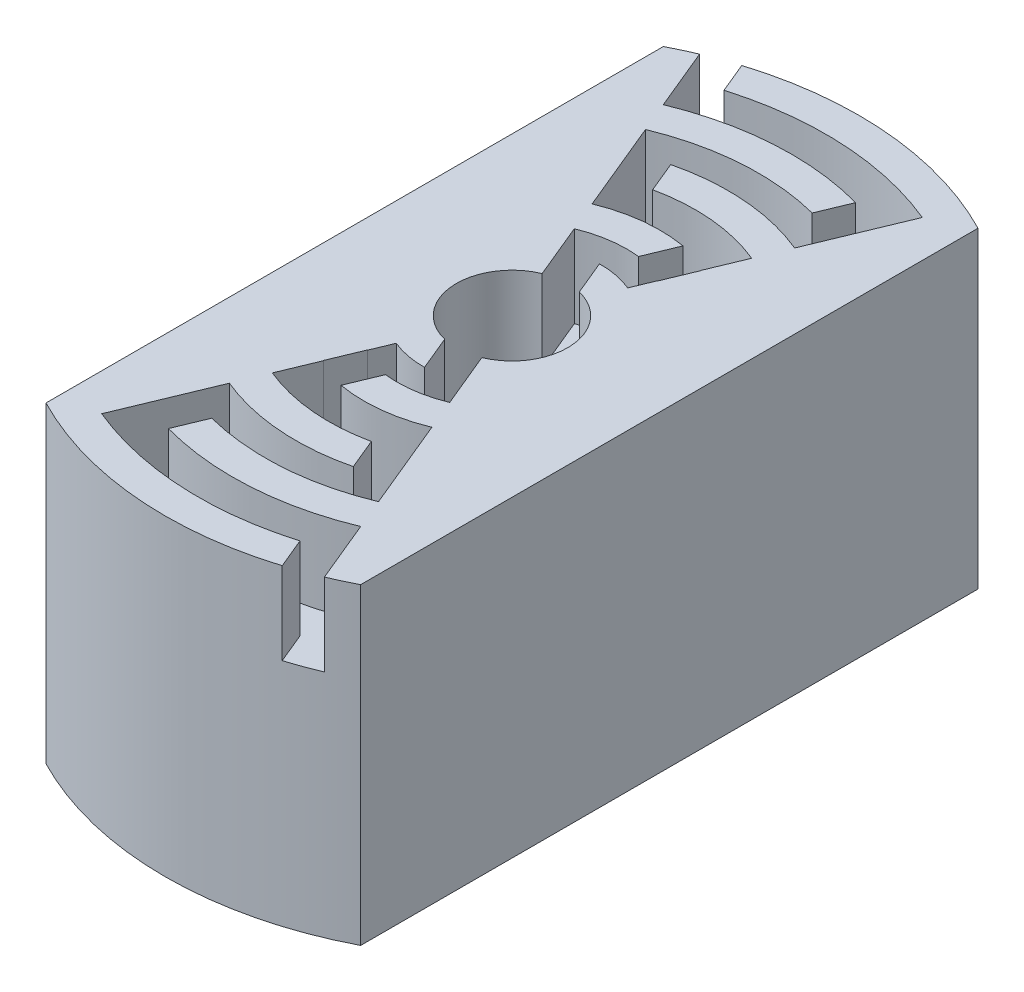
ISO-10303-21;
HEADER;
FILE_DESCRIPTION(('STEP AP214'),'2;1');
FILE_NAME('part.step','',(''),(''),'','','');
FILE_SCHEMA(('AUTOMOTIVE_DESIGN { 1 0 10303 214 1 1 1 1 }'));
ENDSEC;
DATA;
#1=APPLICATION_CONTEXT('core data for automotive mechanical design processes');
#2=APPLICATION_PROTOCOL_DEFINITION('international standard','automotive_design',2000,#1);
#3=PRODUCT_CONTEXT('',#1,'mechanical');
#4=PRODUCT('Part','Part','',(#3));
#5=PRODUCT_RELATED_PRODUCT_CATEGORY('part','',(#4));
#6=PRODUCT_DEFINITION_FORMATION('','',#4);
#7=PRODUCT_DEFINITION_CONTEXT('part definition',#1,'design');
#8=PRODUCT_DEFINITION('design','',#6,#7);
#9=PRODUCT_DEFINITION_SHAPE('','',#8);
#10=(LENGTH_UNIT() NAMED_UNIT(*) SI_UNIT(.MILLI.,.METRE.));
#11=(NAMED_UNIT(*) PLANE_ANGLE_UNIT() SI_UNIT($,.RADIAN.));
#12=(NAMED_UNIT(*) SI_UNIT($,.STERADIAN.) SOLID_ANGLE_UNIT());
#13=UNCERTAINTY_MEASURE_WITH_UNIT(LENGTH_MEASURE(1.E-05),#10,'distance_accuracy_value','');
#14=(GEOMETRIC_REPRESENTATION_CONTEXT(3) GLOBAL_UNCERTAINTY_ASSIGNED_CONTEXT((#13)) GLOBAL_UNIT_ASSIGNED_CONTEXT((#10,
#11,#12)) REPRESENTATION_CONTEXT('',''));
#15=CARTESIAN_POINT('',(0.,0.,0.));
#16=DIRECTION('',(0.,0.,1.));
#17=DIRECTION('',(1.,0.,0.));
#18=AXIS2_PLACEMENT_3D('',#15,#16,#17);
#19=CARTESIAN_POINT('',(-1.02765526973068E-13,-1.33691413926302,0.));
#20=DIRECTION('',(0.,-1.,0.));
#21=DIRECTION('',(-0.382683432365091,0.,-0.923879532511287));
#22=AXIS2_PLACEMENT_3D('',#19,#20,#21);
#23=CYLINDRICAL_SURFACE('',#22,1.35437005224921);
#24=CARTESIAN_POINT('',(-1.02765526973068E-13,-4.33691413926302,0.));
#25=DIRECTION('',(0.,-1.,0.));
#26=DIRECTION('',(-0.382683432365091,0.,-0.923879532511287));
#27=AXIS2_PLACEMENT_3D('',#24,#25,#26);
#28=CIRCLE('',#27,1.35437005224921);
#29=CARTESIAN_POINT('',(0.320888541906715,-4.33691413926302,-1.31580727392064));
#30=VERTEX_POINT('',#29);
#31=CARTESIAN_POINT('',(0.518294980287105,-4.33691413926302,1.2512747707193));
#32=VERTEX_POINT('',#31);
#33=EDGE_CURVE('E633',#30,#32,#28,.T.);
#34=ORIENTED_EDGE('',*,*,#33,.F.);
#35=DIRECTION('',(0.,-1.,0.));
#36=VECTOR('',#35,1.);
#37=CARTESIAN_POINT('',(0.320888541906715,-1.33691413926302,-1.31580727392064));
#38=LINE('',#37,#36);
#39=CARTESIAN_POINT('',(0.320888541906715,-6.33691413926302,-1.31580727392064));
#40=VERTEX_POINT('',#39);
#41=EDGE_CURVE('E771',#30,#40,#38,.T.);
#42=ORIENTED_EDGE('',*,*,#41,.T.);
#43=CARTESIAN_POINT('',(-1.02765526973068E-13,-6.33691413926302,0.));
#44=DIRECTION('',(0.,-1.,0.));
#45=DIRECTION('',(0.,0.,-1.));
#46=AXIS2_PLACEMENT_3D('',#43,#44,#45);
#47=CIRCLE('',#46,1.35437005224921);
#48=CARTESIAN_POINT('',(-0.518294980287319,-6.33691413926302,-1.25127477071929));
#49=VERTEX_POINT('',#48);
#50=EDGE_CURVE('E443',#49,#40,#47,.T.);
#51=ORIENTED_EDGE('',*,*,#50,.F.);
#52=DIRECTION('',(0.,-1.,0.));
#53=VECTOR('',#52,1.);
#54=CARTESIAN_POINT('',(-0.518294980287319,-1.33691413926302,-1.25127477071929));
#55=LINE('',#54,#53);
#56=CARTESIAN_POINT('',(-0.518294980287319,-4.33691413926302,-1.25127477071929));
#57=VERTEX_POINT('',#56);
#58=EDGE_CURVE('E484',#57,#49,#55,.T.);
#59=ORIENTED_EDGE('',*,*,#58,.F.);
#60=CARTESIAN_POINT('',(-1.02765526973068E-13,-4.33691413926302,0.));
#61=DIRECTION('',(0.,-1.,0.));
#62=DIRECTION('',(-0.382683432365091,0.,-0.923879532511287));
#63=AXIS2_PLACEMENT_3D('',#60,#61,#62);
#64=CIRCLE('',#63,1.35437005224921);
#65=CARTESIAN_POINT('',(-0.320888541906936,-4.33691413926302,1.31580727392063));
#66=VERTEX_POINT('',#65);
#67=EDGE_CURVE('E455',#66,#57,#64,.T.);
#68=ORIENTED_EDGE('',*,*,#67,.F.);
#69=DIRECTION('',(0.,-1.,0.));
#70=VECTOR('',#69,1.);
#71=CARTESIAN_POINT('',(-0.320888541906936,-1.33691413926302,1.31580727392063));
#72=LINE('',#71,#70);
#73=CARTESIAN_POINT('',(-0.320888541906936,-6.33691413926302,1.31580727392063));
#74=VERTEX_POINT('',#73);
#75=EDGE_CURVE('E601',#66,#74,#72,.T.);
#76=ORIENTED_EDGE('',*,*,#75,.T.);
#77=CARTESIAN_POINT('',(0.518294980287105,-6.33691413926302,1.25127477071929));
#78=VERTEX_POINT('',#77);
#79=EDGE_CURVE('E445',#78,#74,#47,.T.);
#80=ORIENTED_EDGE('',*,*,#79,.F.);
#81=DIRECTION('',(0.,-1.,0.));
#82=VECTOR('',#81,1.);
#83=CARTESIAN_POINT('',(0.518294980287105,-1.33691413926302,1.2512747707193));
#84=LINE('',#83,#82);
#85=EDGE_CURVE('E649',#32,#78,#84,.T.);
#86=ORIENTED_EDGE('',*,*,#85,.F.);
#87=EDGE_LOOP('',(#34,#42,#51,#59,#68,#76,#80,#86));
#88=FACE_BOUND('',#87,.T.);
#89=CARTESIAN_POINT('',(-1.02765526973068E-13,-10.936914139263,0.));
#90=DIRECTION('',(0.,-1.,0.));
#91=DIRECTION('',(0.,0.,-1.));
#92=AXIS2_PLACEMENT_3D('',#89,#90,#91);
#93=CIRCLE('',#92,1.35437005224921);
#94=CARTESIAN_POINT('',(-1.02765526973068E-13,-10.936914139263,-1.35437005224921));
#95=VERTEX_POINT('',#94);
#96=EDGE_CURVE('E69',#95,#95,#93,.F.);
#97=ORIENTED_EDGE('',*,*,#96,.F.);
#98=EDGE_LOOP('',(#97));
#99=FACE_BOUND('',#98,.T.);
#100=ADVANCED_FACE('F65',(#88,#99),#23,.F.);
#101=CARTESIAN_POINT('',(-1.02765526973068E-13,-6.33691413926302,0.));
#102=DIRECTION('',(0.,-1.,0.));
#103=DIRECTION('',(-0.382683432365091,0.,-0.923879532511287));
#104=AXIS2_PLACEMENT_3D('',#101,#102,#103);
#105=PLANE('',#104);
#106=CARTESIAN_POINT('',(-1.355530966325E-13,-6.33691413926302,0.107821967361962));
#107=DIRECTION('',(0.,-1.,0.));
#108=DIRECTION('',(0.,0.,-1.));
#109=AXIS2_PLACEMENT_3D('',#106,#107,#108);
#110=CIRCLE('',#109,8.33018727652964);
#111=CARTESIAN_POINT('',(3.22590637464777,-6.33691413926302,7.78802692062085));
#112=VERTEX_POINT('',#111);
#113=CARTESIAN_POINT('',(2.47359104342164,-6.33691413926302,8.06227778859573));
#114=VERTEX_POINT('',#113);
#115=EDGE_CURVE('E88',#112,#114,#110,.T.);
#116=ORIENTED_EDGE('',*,*,#115,.F.);
#117=DIRECTION('',(0.382683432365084,0.,0.923879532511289));
#118=VECTOR('',#117,1.);
#119=CARTESIAN_POINT('',(-1.02765526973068E-13,-6.33691413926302,0.));
#120=LINE('',#119,#118);
#121=CARTESIAN_POINT('',(2.60224734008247,-6.33691413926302,6.28238082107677));
#122=VERTEX_POINT('',#121);
#123=EDGE_CURVE('E759',#122,#112,#120,.T.);
#124=ORIENTED_EDGE('',*,*,#123,.F.);
#125=CARTESIAN_POINT('',(-1.02765526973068E-13,-6.33691413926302,0.));
#126=DIRECTION('',(0.,-1.,0.));
#127=DIRECTION('',(0.382683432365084,0.,0.923879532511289));
#128=AXIS2_PLACEMENT_3D('',#125,#126,#127);
#129=CIRCLE('',#128,6.8);
#130=CARTESIAN_POINT('',(-1.79868643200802,-6.33691413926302,6.55779895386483));
#131=VERTEX_POINT('',#130);
#132=EDGE_CURVE('E744',#122,#131,#129,.T.);
#133=ORIENTED_EDGE('',*,*,#132,.T.);
#134=DIRECTION('',(0.382683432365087,0.,-0.923879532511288));
#135=VECTOR('',#134,1.);
#136=CARTESIAN_POINT('',(-1.79868643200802,-6.33691413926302,6.55779895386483));
#137=LINE('',#136,#135);
#138=CARTESIAN_POINT('',(-1.48980672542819,-6.33691413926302,5.81209737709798));
#139=VERTEX_POINT('',#138);
#140=EDGE_CURVE('E642',#131,#139,#137,.T.);
#141=ORIENTED_EDGE('',*,*,#140,.T.);
#142=CARTESIAN_POINT('',(-1.02765526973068E-13,-6.33691413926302,0.));
#143=DIRECTION('',(0.,1.,0.));
#144=DIRECTION('',(-0.923879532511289,0.,0.382683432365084));
#145=AXIS2_PLACEMENT_3D('',#142,#143,#144);
#146=CIRCLE('',#145,6.);
#147=CARTESIAN_POINT('',(2.2961005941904,-6.33691413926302,5.54327719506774));
#148=VERTEX_POINT('',#147);
#149=EDGE_CURVE('E739',#148,#139,#146,.F.);
#150=ORIENTED_EDGE('',*,*,#149,.F.);
#151=CARTESIAN_POINT('',(1.3776603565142,-6.33691413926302,3.32596631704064));
#152=VERTEX_POINT('',#151);
#153=EDGE_CURVE('E768',#152,#148,#120,.T.);
#154=ORIENTED_EDGE('',*,*,#153,.F.);
#155=CARTESIAN_POINT('',(-1.02765526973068E-13,-6.33691413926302,0.));
#156=DIRECTION('',(0.,-1.,0.));
#157=DIRECTION('',(0.382683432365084,0.,0.923879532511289));
#158=AXIS2_PLACEMENT_3D('',#155,#156,#157);
#159=CIRCLE('',#158,3.6);
#160=CARTESIAN_POINT('',(-0.6108966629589,-6.33691413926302,3.5477887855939));
#161=VERTEX_POINT('',#160);
#162=EDGE_CURVE('E724',#152,#161,#159,.T.);
#163=ORIENTED_EDGE('',*,*,#162,.T.);
#164=DIRECTION('',(0.382683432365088,0.,-0.923879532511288));
#165=VECTOR('',#164,1.);
#166=CARTESIAN_POINT('',(-0.6108966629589,-6.33691413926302,3.5477887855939));
#167=LINE('',#166,#165);
#168=CARTESIAN_POINT('',(-0.294710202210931,-6.33691413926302,2.7844471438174));
#169=VERTEX_POINT('',#168);
#170=EDGE_CURVE('E635',#161,#169,#167,.T.);
#171=ORIENTED_EDGE('',*,*,#170,.T.);
#172=CARTESIAN_POINT('',(-1.02765526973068E-13,-6.33691413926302,0.));
#173=DIRECTION('',(0.,1.,0.));
#174=DIRECTION('',(-0.923879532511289,0.,0.382683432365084));
#175=AXIS2_PLACEMENT_3D('',#172,#173,#174);
#176=CIRCLE('',#175,2.8);
#177=CARTESIAN_POINT('',(1.07151361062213,-6.33691413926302,2.58686269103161));
#178=VERTEX_POINT('',#177);
#179=EDGE_CURVE('E719',#178,#169,#176,.F.);
#180=ORIENTED_EDGE('',*,*,#179,.F.);
#181=EDGE_CURVE('E765',#78,#178,#120,.T.);
#182=ORIENTED_EDGE('',*,*,#181,.F.);
#183=ORIENTED_EDGE('',*,*,#79,.T.);
#184=DIRECTION('',(-0.382683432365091,0.,-0.923879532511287));
#185=VECTOR('',#184,1.);
#186=CARTESIAN_POINT('',(0.0262632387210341,-6.33691413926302,2.15390581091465));
#187=LINE('',#186,#185);
#188=CARTESIAN_POINT('',(0.0262632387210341,-6.33691413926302,2.15390581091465));
#189=VERTEX_POINT('',#188);
#190=EDGE_CURVE('E503',#189,#74,#187,.T.);
#191=ORIENTED_EDGE('',*,*,#190,.F.);
#192=CARTESIAN_POINT('',(-1.02765526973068E-13,-6.33691413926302,0.));
#193=DIRECTION('',(0.,-1.,0.));
#194=DIRECTION('',(0.382683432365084,0.,0.923879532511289));
#195=AXIS2_PLACEMENT_3D('',#192,#193,#194);
#196=CIRCLE('',#195,2.1540659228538);
#197=CARTESIAN_POINT('',(-0.824325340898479,-6.33691413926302,1.99009741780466));
#198=VERTEX_POINT('',#197);
#199=EDGE_CURVE('E498',#189,#198,#196,.T.);
#200=ORIENTED_EDGE('',*,*,#199,.T.);
#201=DIRECTION('',(-0.382683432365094,0.,0.923879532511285));
#202=VECTOR('',#201,1.);
#203=CARTESIAN_POINT('',(-1.02765526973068E-13,-6.33691413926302,0.));
#204=LINE('',#203,#202);
#205=CARTESIAN_POINT('',(-1.02761003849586,-6.33691413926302,2.48087009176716));
#206=VERTEX_POINT('',#205);
#207=EDGE_CURVE('E546',#198,#206,#204,.T.);
#208=ORIENTED_EDGE('',*,*,#207,.T.);
#209=DIRECTION('',(0.923879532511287,0.,0.382683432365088));
#210=VECTOR('',#209,1.);
#211=CARTESIAN_POINT('',(-1.03381382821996,-6.33691413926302,2.47830039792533));
#212=LINE('',#211,#210);
#213=CARTESIAN_POINT('',(-1.03381382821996,-6.33691413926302,2.47830039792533));
#214=VERTEX_POINT('',#213);
#215=EDGE_CURVE('E464',#214,#206,#212,.T.);
#216=ORIENTED_EDGE('',*,*,#215,.F.);
#217=DIRECTION('',(0.382683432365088,0.,-0.923879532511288));
#218=VECTOR('',#217,1.);
#219=CARTESIAN_POINT('',(-1.35000028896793,-6.33691413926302,3.24164203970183));
#220=LINE('',#219,#218);
#221=CARTESIAN_POINT('',(-1.35000028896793,-6.33691413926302,3.24164203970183));
#222=VERTEX_POINT('',#221);
#223=EDGE_CURVE('E466',#222,#214,#220,.T.);
#224=ORIENTED_EDGE('',*,*,#223,.F.);
#225=DIRECTION('',(-0.923879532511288,0.,-0.382683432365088));
#226=VECTOR('',#225,1.);
#227=CARTESIAN_POINT('',(-0.6108966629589,-6.33691413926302,3.5477887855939));
#228=LINE('',#227,#226);
#229=CARTESIAN_POINT('',(-1.34379649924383,-6.33691413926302,3.24421173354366));
#230=VERTEX_POINT('',#229);
#231=EDGE_CURVE('E469',#230,#222,#228,.T.);
#232=ORIENTED_EDGE('',*,*,#231,.F.);
#233=CARTESIAN_POINT('',(-1.70721912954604,-6.33691413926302,4.12159157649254));
#234=VERTEX_POINT('',#233);
#235=EDGE_CURVE('E549',#230,#234,#204,.T.);
#236=ORIENTED_EDGE('',*,*,#235,.T.);
#237=CARTESIAN_POINT('',(-1.02765526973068E-13,-6.33691413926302,0.));
#238=DIRECTION('',(0.,1.,0.));
#239=DIRECTION('',(-0.923879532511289,0.,0.382683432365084));
#240=AXIS2_PLACEMENT_3D('',#237,#238,#239);
#241=CIRCLE('',#240,4.46117857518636);
#242=CARTESIAN_POINT('',(0.940441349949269,-6.33691413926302,4.36092700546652));
#243=VERTEX_POINT('',#242);
#244=EDGE_CURVE('E518',#243,#234,#241,.F.);
#245=ORIENTED_EDGE('',*,*,#244,.F.);
#246=DIRECTION('',(-0.382683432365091,0.,-0.923879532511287));
#247=VECTOR('',#246,1.);
#248=CARTESIAN_POINT('',(1.2508502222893,-6.33691413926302,5.11032031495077));
#249=LINE('',#248,#247);
#250=CARTESIAN_POINT('',(1.2508502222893,-6.33691413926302,5.11032031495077));
#251=VERTEX_POINT('',#250);
#252=EDGE_CURVE('E490',#251,#243,#249,.T.);
#253=ORIENTED_EDGE('',*,*,#252,.F.);
#254=CARTESIAN_POINT('',(-1.02765526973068E-13,-6.33691413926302,0.));
#255=DIRECTION('',(0.,-1.,0.));
#256=DIRECTION('',(0.382683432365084,0.,0.923879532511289));
#257=AXIS2_PLACEMENT_3D('',#254,#255,#256);
#258=CIRCLE('',#257,5.26117857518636);
#259=CARTESIAN_POINT('',(-2.01336587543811,-6.33691413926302,4.86069520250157));
#260=VERTEX_POINT('',#259);
#261=EDGE_CURVE('E523',#251,#260,#258,.T.);
#262=ORIENTED_EDGE('',*,*,#261,.T.);
#263=CARTESIAN_POINT('',(-2.92293959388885,-6.33691413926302,7.05660040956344));
#264=VERTEX_POINT('',#263);
#265=EDGE_CURVE('E538',#260,#264,#204,.T.);
#266=ORIENTED_EDGE('',*,*,#265,.T.);
#267=CARTESIAN_POINT('',(-1.02765526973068E-13,-6.33691413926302,0.));
#268=DIRECTION('',(0.,1.,0.));
#269=DIRECTION('',(-0.923879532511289,0.,0.382683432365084));
#270=AXIS2_PLACEMENT_3D('',#267,#268,#269);
#271=CIRCLE('',#270,7.6380092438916);
#272=CARTESIAN_POINT('',(2.16775895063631,-6.33691413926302,7.32393380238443));
#273=VERTEX_POINT('',#272);
#274=EDGE_CURVE('E535',#273,#264,#271,.F.);
#275=ORIENTED_EDGE('',*,*,#274,.F.);
#276=DIRECTION('',(-0.382683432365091,0.,-0.923879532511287));
#277=VECTOR('',#276,1.);
#278=CARTESIAN_POINT('',(2.47543720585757,-6.33691413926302,8.0667348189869));
#279=LINE('',#278,#277);
#280=EDGE_CURVE('E499',#114,#273,#279,.T.);
#281=ORIENTED_EDGE('',*,*,#280,.F.);
#282=EDGE_LOOP('',(#116,#124,#133,#141,#150,#154,#163,#171,#180,#182,#183,#191,#200,#208,#216,
#224,#232,#236,#245,#253,#262,#266,#275,#281));
#283=FACE_BOUND('',#282,.T.);
#284=ADVANCED_FACE('F787',(#283),#105,.F.);
#285=CARTESIAN_POINT('',(-1.34904613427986E-13,-6.33691413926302,-0.107821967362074));
#286=DIRECTION('',(0.,-1.,0.));
#287=DIRECTION('',(0.,0.,-1.));
#288=AXIS2_PLACEMENT_3D('',#285,#286,#287);
#289=CIRCLE('',#288,8.33018727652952);
#290=CARTESIAN_POINT('',(-3.22590637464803,-6.33691413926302,-7.78802692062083));
#291=VERTEX_POINT('',#290);
#292=CARTESIAN_POINT('',(-2.47359104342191,-6.33691413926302,-8.06227778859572));
#293=VERTEX_POINT('',#292);
#294=EDGE_CURVE('E438',#291,#293,#289,.T.);
#295=ORIENTED_EDGE('',*,*,#294,.F.);
#296=DIRECTION('',(-0.382683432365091,0.,-0.923879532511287));
#297=VECTOR('',#296,1.);
#298=CARTESIAN_POINT('',(-1.02765526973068E-13,-6.33691413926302,0.));
#299=LINE('',#298,#297);
#300=CARTESIAN_POINT('',(-2.60224734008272,-6.33691413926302,-6.28238082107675));
#301=VERTEX_POINT('',#300);
#302=EDGE_CURVE('E590',#301,#291,#299,.T.);
#303=ORIENTED_EDGE('',*,*,#302,.F.);
#304=CARTESIAN_POINT('',(-1.02765526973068E-13,-6.33691413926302,0.));
#305=DIRECTION('',(0.,-1.,0.));
#306=DIRECTION('',(-0.382683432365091,0.,-0.923879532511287));
#307=AXIS2_PLACEMENT_3D('',#304,#305,#306);
#308=CIRCLE('',#307,6.8);
#309=CARTESIAN_POINT('',(1.79868643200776,-6.33691413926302,-6.55779895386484));
#310=VERTEX_POINT('',#309);
#311=EDGE_CURVE('E574',#301,#310,#308,.T.);
#312=ORIENTED_EDGE('',*,*,#311,.T.);
#313=DIRECTION('',(-0.38268343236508,0.,0.923879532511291));
#314=VECTOR('',#313,1.);
#315=CARTESIAN_POINT('',(1.79868643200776,-6.33691413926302,-6.55779895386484));
#316=LINE('',#315,#314);
#317=CARTESIAN_POINT('',(1.48980672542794,-6.33691413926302,-5.81209737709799));
#318=VERTEX_POINT('',#317);
#319=EDGE_CURVE('E446',#310,#318,#316,.T.);
#320=ORIENTED_EDGE('',*,*,#319,.T.);
#321=CARTESIAN_POINT('',(-1.02765526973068E-13,-6.33691413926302,0.));
#322=DIRECTION('',(0.,1.,0.));
#323=DIRECTION('',(0.923879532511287,0.,-0.382683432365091));
#324=AXIS2_PLACEMENT_3D('',#321,#322,#323);
#325=CIRCLE('',#324,6.);
#326=CARTESIAN_POINT('',(-2.29610059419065,-6.33691413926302,-5.54327719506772));
#327=VERTEX_POINT('',#326);
#328=EDGE_CURVE('E569',#327,#318,#325,.F.);
#329=ORIENTED_EDGE('',*,*,#328,.F.);
#330=CARTESIAN_POINT('',(-1.37766035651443,-6.33691413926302,-3.32596631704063));
#331=VERTEX_POINT('',#330);
#332=EDGE_CURVE('E598',#331,#327,#299,.T.);
#333=ORIENTED_EDGE('',*,*,#332,.F.);
#334=CARTESIAN_POINT('',(-1.02765526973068E-13,-6.33691413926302,0.));
#335=DIRECTION('',(0.,-1.,0.));
#336=DIRECTION('',(-0.382683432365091,0.,-0.923879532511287));
#337=AXIS2_PLACEMENT_3D('',#334,#335,#336);
#338=CIRCLE('',#337,3.6);
#339=CARTESIAN_POINT('',(0.610896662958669,-6.33691413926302,-3.5477887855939));
#340=VERTEX_POINT('',#339);
#341=EDGE_CURVE('E554',#331,#340,#338,.T.);
#342=ORIENTED_EDGE('',*,*,#341,.T.);
#343=DIRECTION('',(-0.382683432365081,0.,0.923879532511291));
#344=VECTOR('',#343,1.);
#345=CARTESIAN_POINT('',(0.610896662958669,-6.33691413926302,-3.5477887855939));
#346=LINE('',#345,#344);
#347=CARTESIAN_POINT('',(0.294710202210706,-6.33691413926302,-2.7844471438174));
#348=VERTEX_POINT('',#347);
#349=EDGE_CURVE('E456',#340,#348,#346,.T.);
#350=ORIENTED_EDGE('',*,*,#349,.T.);
#351=CARTESIAN_POINT('',(-1.02765526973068E-13,-6.33691413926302,0.));
#352=DIRECTION('',(0.,1.,0.));
#353=DIRECTION('',(0.923879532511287,0.,-0.382683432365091));
#354=AXIS2_PLACEMENT_3D('',#351,#352,#353);
#355=CIRCLE('',#354,2.8);
#356=CARTESIAN_POINT('',(-1.07151361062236,-6.33691413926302,-2.5868626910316));
#357=VERTEX_POINT('',#356);
#358=EDGE_CURVE('E543',#357,#348,#355,.F.);
#359=ORIENTED_EDGE('',*,*,#358,.F.);
#360=EDGE_CURVE('E596',#49,#357,#299,.T.);
#361=ORIENTED_EDGE('',*,*,#360,.F.);
#362=ORIENTED_EDGE('',*,*,#50,.T.);
#363=DIRECTION('',(0.382683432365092,0.,0.923879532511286));
#364=VECTOR('',#363,1.);
#365=CARTESIAN_POINT('',(-0.0262632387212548,-6.33691413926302,-2.15390581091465));
#366=LINE('',#365,#364);
#367=CARTESIAN_POINT('',(-0.0262632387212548,-6.33691413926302,-2.15390581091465));
#368=VERTEX_POINT('',#367);
#369=EDGE_CURVE('E668',#368,#40,#366,.T.);
#370=ORIENTED_EDGE('',*,*,#369,.F.);
#371=CARTESIAN_POINT('',(-1.02765526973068E-13,-6.33691413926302,0.));
#372=DIRECTION('',(0.,-1.,0.));
#373=DIRECTION('',(-0.382683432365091,0.,-0.923879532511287));
#374=AXIS2_PLACEMENT_3D('',#371,#372,#373);
#375=CIRCLE('',#374,2.1540659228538);
#376=CARTESIAN_POINT('',(0.824325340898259,-6.33691413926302,-1.99009741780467));
#377=VERTEX_POINT('',#376);
#378=EDGE_CURVE('E661',#368,#377,#375,.T.);
#379=ORIENTED_EDGE('',*,*,#378,.T.);
#380=DIRECTION('',(0.382683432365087,0.,-0.923879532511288));
#381=VECTOR('',#380,1.);
#382=CARTESIAN_POINT('',(-1.02765526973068E-13,-6.33691413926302,0.));
#383=LINE('',#382,#381);
#384=CARTESIAN_POINT('',(1.02761003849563,-6.33691413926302,-2.48087009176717));
#385=VERTEX_POINT('',#384);
#386=EDGE_CURVE('E703',#377,#385,#383,.T.);
#387=ORIENTED_EDGE('',*,*,#386,.T.);
#388=DIRECTION('',(-0.923879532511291,0.,-0.382683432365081));
#389=VECTOR('',#388,1.);
#390=CARTESIAN_POINT('',(1.03381382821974,-6.33691413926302,-2.47830039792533));
#391=LINE('',#390,#389);
#392=CARTESIAN_POINT('',(1.03381382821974,-6.33691413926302,-2.47830039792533));
#393=VERTEX_POINT('',#392);
#394=EDGE_CURVE('E611',#393,#385,#391,.T.);
#395=ORIENTED_EDGE('',*,*,#394,.F.);
#396=DIRECTION('',(-0.382683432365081,0.,0.923879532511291));
#397=VECTOR('',#396,1.);
#398=CARTESIAN_POINT('',(1.3500002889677,-6.33691413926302,-3.24164203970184));
#399=LINE('',#398,#397);
#400=CARTESIAN_POINT('',(1.3500002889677,-6.33691413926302,-3.24164203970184));
#401=VERTEX_POINT('',#400);
#402=EDGE_CURVE('E614',#401,#393,#399,.T.);
#403=ORIENTED_EDGE('',*,*,#402,.F.);
#404=DIRECTION('',(0.923879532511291,0.,0.382683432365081));
#405=VECTOR('',#404,1.);
#406=CARTESIAN_POINT('',(0.610896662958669,-6.33691413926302,-3.5477887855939));
#407=LINE('',#406,#405);
#408=CARTESIAN_POINT('',(1.3437964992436,-6.33691413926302,-3.24421173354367));
#409=VERTEX_POINT('',#408);
#410=EDGE_CURVE('E618',#409,#401,#407,.T.);
#411=ORIENTED_EDGE('',*,*,#410,.F.);
#412=CARTESIAN_POINT('',(1.7072191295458,-6.33691413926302,-4.12159157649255));
#413=VERTEX_POINT('',#412);
#414=EDGE_CURVE('E705',#409,#413,#383,.T.);
#415=ORIENTED_EDGE('',*,*,#414,.T.);
#416=CARTESIAN_POINT('',(-1.02765526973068E-13,-6.33691413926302,0.));
#417=DIRECTION('',(0.,1.,0.));
#418=DIRECTION('',(0.923879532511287,0.,-0.382683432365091));
#419=AXIS2_PLACEMENT_3D('',#416,#417,#418);
#420=CIRCLE('',#419,4.46117857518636);
#421=CARTESIAN_POINT('',(-0.940441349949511,-6.33691413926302,-4.36092700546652));
#422=VERTEX_POINT('',#421);
#423=EDGE_CURVE('E683',#422,#413,#420,.F.);
#424=ORIENTED_EDGE('',*,*,#423,.F.);
#425=DIRECTION('',(0.382683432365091,0.,0.923879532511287));
#426=VECTOR('',#425,1.);
#427=CARTESIAN_POINT('',(-1.25085022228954,-6.33691413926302,-5.11032031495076));
#428=LINE('',#427,#426);
#429=CARTESIAN_POINT('',(-1.25085022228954,-6.33691413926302,-5.11032031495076));
#430=VERTEX_POINT('',#429);
#431=EDGE_CURVE('E662',#430,#422,#428,.T.);
#432=ORIENTED_EDGE('',*,*,#431,.F.);
#433=CARTESIAN_POINT('',(-1.02765526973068E-13,-6.33691413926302,0.));
#434=DIRECTION('',(0.,-1.,0.));
#435=DIRECTION('',(-0.382683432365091,0.,-0.923879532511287));
#436=AXIS2_PLACEMENT_3D('',#433,#434,#435);
#437=CIRCLE('',#436,5.26117857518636);
#438=CARTESIAN_POINT('',(2.01336587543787,-6.33691413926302,-4.86069520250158));
#439=VERTEX_POINT('',#438);
#440=EDGE_CURVE('E688',#430,#439,#437,.T.);
#441=ORIENTED_EDGE('',*,*,#440,.T.);
#442=CARTESIAN_POINT('',(2.9229395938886,-6.33691413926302,-7.05660040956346));
#443=VERTEX_POINT('',#442);
#444=EDGE_CURVE('E696',#439,#443,#383,.T.);
#445=ORIENTED_EDGE('',*,*,#444,.T.);
#446=CARTESIAN_POINT('',(-1.02765526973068E-13,-6.33691413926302,0.));
#447=DIRECTION('',(0.,1.,0.));
#448=DIRECTION('',(0.923879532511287,0.,-0.382683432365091));
#449=AXIS2_PLACEMENT_3D('',#446,#447,#448);
#450=CIRCLE('',#449,7.6380092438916);
#451=CARTESIAN_POINT('',(-2.16775895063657,-6.33691413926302,-7.32393380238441));
#452=VERTEX_POINT('',#451);
#453=EDGE_CURVE('E708',#452,#443,#450,.F.);
#454=ORIENTED_EDGE('',*,*,#453,.F.);
#455=DIRECTION('',(0.382683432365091,0.,0.923879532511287));
#456=VECTOR('',#455,1.);
#457=CARTESIAN_POINT('',(-2.47543720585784,-6.33691413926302,-8.06673481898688));
#458=LINE('',#457,#456);
#459=EDGE_CURVE('E653',#293,#452,#458,.T.);
#460=ORIENTED_EDGE('',*,*,#459,.F.);
#461=EDGE_LOOP('',(#295,#303,#312,#320,#329,#333,#342,#350,#359,#361,#362,#370,#379,#387,#395,
#403,#411,#415,#424,#432,#441,#445,#454,#460));
#462=FACE_BOUND('',#461,.T.);
#463=ADVANCED_FACE('F852',(#462),#105,.F.);
#464=CARTESIAN_POINT('',(-1.02765526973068E-13,-4.33691413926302,0.));
#465=DIRECTION('',(0.,1.,0.));
#466=DIRECTION('',(0.923879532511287,0.,-0.382683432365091));
#467=AXIS2_PLACEMENT_3D('',#464,#465,#466);
#468=PLANE('',#467);
#469=DIRECTION('',(-0.382683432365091,0.,-0.923879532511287));
#470=VECTOR('',#469,1.);
#471=CARTESIAN_POINT('',(-1.02765526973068E-13,-4.33691413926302,0.));
#472=LINE('',#471,#470);
#473=CARTESIAN_POINT('',(-2.60224734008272,-4.33691413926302,-6.28238082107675));
#474=VERTEX_POINT('',#473);
#475=CARTESIAN_POINT('',(-3.22590637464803,-4.33691413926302,-7.78802692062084));
#476=VERTEX_POINT('',#475);
#477=EDGE_CURVE('E595',#474,#476,#472,.T.);
#478=ORIENTED_EDGE('',*,*,#477,.T.);
#479=CARTESIAN_POINT('',(-1.34904613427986E-13,-4.33691413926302,-0.107821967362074));
#480=DIRECTION('',(0.,1.,0.));
#481=DIRECTION('',(0.,0.,-1.));
#482=AXIS2_PLACEMENT_3D('',#479,#480,#481);
#483=CIRCLE('',#482,8.33018727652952);
#484=CARTESIAN_POINT('',(-3.82683432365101,-4.33691413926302,-7.50696780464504));
#485=VERTEX_POINT('',#484);
#486=EDGE_CURVE('E80',#476,#485,#483,.T.);
#487=ORIENTED_EDGE('',*,*,#486,.T.);
#488=DIRECTION('',(0.,0.,-1.));
#489=VECTOR('',#488,1.);
#490=CARTESIAN_POINT('',(-3.82683432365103,-4.33691413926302,0.));
#491=LINE('',#490,#489);
#492=CARTESIAN_POINT('',(-3.82683432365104,-4.33691413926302,7.50696780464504));
#493=VERTEX_POINT('',#492);
#494=EDGE_CURVE('E487',#493,#485,#491,.T.);
#495=ORIENTED_EDGE('',*,*,#494,.F.);
#496=CARTESIAN_POINT('',(-1.355530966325E-13,-4.33691413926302,0.107821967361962));
#497=DIRECTION('',(0.,1.,0.));
#498=DIRECTION('',(0.,0.,-1.));
#499=AXIS2_PLACEMENT_3D('',#496,#497,#498);
#500=CIRCLE('',#499,8.33018727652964);
#501=CARTESIAN_POINT('',(2.47359104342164,-4.33691413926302,8.06227778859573));
#502=VERTEX_POINT('',#501);
#503=EDGE_CURVE('E399',#493,#502,#500,.T.);
#504=ORIENTED_EDGE('',*,*,#503,.T.);
#505=DIRECTION('',(-0.382683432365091,0.,-0.923879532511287));
#506=VECTOR('',#505,1.);
#507=CARTESIAN_POINT('',(2.47543720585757,-4.33691413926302,8.0667348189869));
#508=LINE('',#507,#506);
#509=CARTESIAN_POINT('',(2.16775895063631,-4.33691413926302,7.32393380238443));
#510=VERTEX_POINT('',#509);
#511=EDGE_CURVE('E501',#502,#510,#508,.T.);
#512=ORIENTED_EDGE('',*,*,#511,.T.);
#513=CARTESIAN_POINT('',(-1.02765526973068E-13,-4.33691413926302,0.));
#514=DIRECTION('',(0.,1.,0.));
#515=DIRECTION('',(-0.923879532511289,0.,0.382683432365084));
#516=AXIS2_PLACEMENT_3D('',#513,#514,#515);
#517=CIRCLE('',#516,7.6380092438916);
#518=CARTESIAN_POINT('',(-2.92293959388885,-4.33691413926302,7.05660040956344));
#519=VERTEX_POINT('',#518);
#520=EDGE_CURVE('E536',#510,#519,#517,.F.);
#521=ORIENTED_EDGE('',*,*,#520,.T.);
#522=DIRECTION('',(-0.382683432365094,0.,0.923879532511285));
#523=VECTOR('',#522,1.);
#524=CARTESIAN_POINT('',(-1.02765526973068E-13,-4.33691413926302,0.));
#525=LINE('',#524,#523);
#526=CARTESIAN_POINT('',(-2.01336587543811,-4.33691413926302,4.86069520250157));
#527=VERTEX_POINT('',#526);
#528=EDGE_CURVE('E545',#527,#519,#525,.T.);
#529=ORIENTED_EDGE('',*,*,#528,.F.);
#530=CARTESIAN_POINT('',(-1.02765526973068E-13,-4.33691413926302,0.));
#531=DIRECTION('',(0.,-1.,0.));
#532=DIRECTION('',(0.382683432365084,0.,0.923879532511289));
#533=AXIS2_PLACEMENT_3D('',#530,#531,#532);
#534=CIRCLE('',#533,5.26117857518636);
#535=CARTESIAN_POINT('',(1.2508502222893,-4.33691413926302,5.11032031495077));
#536=VERTEX_POINT('',#535);
#537=EDGE_CURVE('E522',#536,#527,#534,.T.);
#538=ORIENTED_EDGE('',*,*,#537,.F.);
#539=DIRECTION('',(-0.382683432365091,0.,-0.923879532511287));
#540=VECTOR('',#539,1.);
#541=CARTESIAN_POINT('',(1.2508502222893,-4.33691413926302,5.11032031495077));
#542=LINE('',#541,#540);
#543=CARTESIAN_POINT('',(0.940441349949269,-4.33691413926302,4.36092700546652));
#544=VERTEX_POINT('',#543);
#545=EDGE_CURVE('E493',#536,#544,#542,.T.);
#546=ORIENTED_EDGE('',*,*,#545,.T.);
#547=CARTESIAN_POINT('',(-1.02765526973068E-13,-4.33691413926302,0.));
#548=DIRECTION('',(0.,1.,0.));
#549=DIRECTION('',(-0.923879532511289,0.,0.382683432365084));
#550=AXIS2_PLACEMENT_3D('',#547,#548,#549);
#551=CIRCLE('',#550,4.46117857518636);
#552=CARTESIAN_POINT('',(-1.70721912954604,-4.33691413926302,4.12159157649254));
#553=VERTEX_POINT('',#552);
#554=EDGE_CURVE('E519',#544,#553,#551,.F.);
#555=ORIENTED_EDGE('',*,*,#554,.T.);
#556=CARTESIAN_POINT('',(-1.34379649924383,-4.33691413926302,3.24421173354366));
#557=VERTEX_POINT('',#556);
#558=EDGE_CURVE('E544',#557,#553,#525,.T.);
#559=ORIENTED_EDGE('',*,*,#558,.F.);
#560=DIRECTION('',(-0.923879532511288,0.,-0.382683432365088));
#561=VECTOR('',#560,1.);
#562=CARTESIAN_POINT('',(-0.6108966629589,-4.33691413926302,3.5477887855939));
#563=LINE('',#562,#561);
#564=CARTESIAN_POINT('',(-1.35000028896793,-4.33691413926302,3.24164203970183));
#565=VERTEX_POINT('',#564);
#566=EDGE_CURVE('E467',#557,#565,#563,.T.);
#567=ORIENTED_EDGE('',*,*,#566,.T.);
#568=DIRECTION('',(0.382683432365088,0.,-0.923879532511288));
#569=VECTOR('',#568,1.);
#570=CARTESIAN_POINT('',(-1.35000028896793,-4.33691413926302,3.24164203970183));
#571=LINE('',#570,#569);
#572=CARTESIAN_POINT('',(-1.03381382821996,-4.33691413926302,2.47830039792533));
#573=VERTEX_POINT('',#572);
#574=EDGE_CURVE('E475',#565,#573,#571,.T.);
#575=ORIENTED_EDGE('',*,*,#574,.T.);
#576=DIRECTION('',(0.923879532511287,0.,0.382683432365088));
#577=VECTOR('',#576,1.);
#578=CARTESIAN_POINT('',(-1.03381382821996,-4.33691413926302,2.47830039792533));
#579=LINE('',#578,#577);
#580=CARTESIAN_POINT('',(-1.02761003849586,-4.33691413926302,2.48087009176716));
#581=VERTEX_POINT('',#580);
#582=EDGE_CURVE('E472',#573,#581,#579,.T.);
#583=ORIENTED_EDGE('',*,*,#582,.T.);
#584=CARTESIAN_POINT('',(-0.824325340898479,-4.33691413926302,1.99009741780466));
#585=VERTEX_POINT('',#584);
#586=EDGE_CURVE('E540',#585,#581,#525,.T.);
#587=ORIENTED_EDGE('',*,*,#586,.F.);
#588=CARTESIAN_POINT('',(-1.02765526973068E-13,-4.33691413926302,0.));
#589=DIRECTION('',(0.,-1.,0.));
#590=DIRECTION('',(0.382683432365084,0.,0.923879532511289));
#591=AXIS2_PLACEMENT_3D('',#588,#589,#590);
#592=CIRCLE('',#591,2.1540659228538);
#593=CARTESIAN_POINT('',(0.0262632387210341,-4.33691413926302,2.15390581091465));
#594=VERTEX_POINT('',#593);
#595=EDGE_CURVE('E510',#594,#585,#592,.T.);
#596=ORIENTED_EDGE('',*,*,#595,.F.);
#597=DIRECTION('',(-0.382683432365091,0.,-0.923879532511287));
#598=VECTOR('',#597,1.);
#599=CARTESIAN_POINT('',(0.0262632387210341,-4.33691413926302,2.15390581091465));
#600=LINE('',#599,#598);
#601=EDGE_CURVE('E489',#594,#66,#600,.T.);
#602=ORIENTED_EDGE('',*,*,#601,.T.);
#603=ORIENTED_EDGE('',*,*,#67,.T.);
#604=CARTESIAN_POINT('',(-1.07151361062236,-4.33691413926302,-2.5868626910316));
#605=VERTEX_POINT('',#604);
#606=EDGE_CURVE('E591',#57,#605,#472,.T.);
#607=ORIENTED_EDGE('',*,*,#606,.T.);
#608=CARTESIAN_POINT('',(-1.02765526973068E-13,-4.33691413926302,0.));
#609=DIRECTION('',(0.,1.,0.));
#610=DIRECTION('',(0.923879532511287,0.,-0.382683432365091));
#611=AXIS2_PLACEMENT_3D('',#608,#609,#610);
#612=CIRCLE('',#611,2.8);
#613=CARTESIAN_POINT('',(0.294710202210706,-4.33691413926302,-2.7844471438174));
#614=VERTEX_POINT('',#613);
#615=EDGE_CURVE('E550',#605,#614,#612,.F.);
#616=ORIENTED_EDGE('',*,*,#615,.T.);
#617=DIRECTION('',(-0.382683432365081,0.,0.923879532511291));
#618=VECTOR('',#617,1.);
#619=CARTESIAN_POINT('',(0.610896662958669,-4.33691413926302,-3.5477887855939));
#620=LINE('',#619,#618);
#621=CARTESIAN_POINT('',(0.610896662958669,-4.33691413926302,-3.5477887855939));
#622=VERTEX_POINT('',#621);
#623=EDGE_CURVE('E459',#622,#614,#620,.T.);
#624=ORIENTED_EDGE('',*,*,#623,.F.);
#625=CARTESIAN_POINT('',(-1.02765526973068E-13,-4.33691413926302,0.));
#626=DIRECTION('',(0.,-1.,0.));
#627=DIRECTION('',(-0.382683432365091,0.,-0.923879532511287));
#628=AXIS2_PLACEMENT_3D('',#625,#626,#627);
#629=CIRCLE('',#628,3.6);
#630=CARTESIAN_POINT('',(-1.37766035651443,-4.33691413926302,-3.32596631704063));
#631=VERTEX_POINT('',#630);
#632=EDGE_CURVE('E553',#631,#622,#629,.T.);
#633=ORIENTED_EDGE('',*,*,#632,.F.);
#634=CARTESIAN_POINT('',(-2.29610059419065,-4.33691413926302,-5.54327719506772));
#635=VERTEX_POINT('',#634);
#636=EDGE_CURVE('E594',#631,#635,#472,.T.);
#637=ORIENTED_EDGE('',*,*,#636,.T.);
#638=CARTESIAN_POINT('',(-1.02765526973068E-13,-4.33691413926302,0.));
#639=DIRECTION('',(0.,1.,0.));
#640=DIRECTION('',(0.923879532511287,0.,-0.382683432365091));
#641=AXIS2_PLACEMENT_3D('',#638,#639,#640);
#642=CIRCLE('',#641,6.);
#643=CARTESIAN_POINT('',(1.48980672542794,-4.33691413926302,-5.81209737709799));
#644=VERTEX_POINT('',#643);
#645=EDGE_CURVE('E570',#635,#644,#642,.F.);
#646=ORIENTED_EDGE('',*,*,#645,.T.);
#647=DIRECTION('',(-0.38268343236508,0.,0.923879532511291));
#648=VECTOR('',#647,1.);
#649=CARTESIAN_POINT('',(1.79868643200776,-4.33691413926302,-6.55779895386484));
#650=LINE('',#649,#648);
#651=CARTESIAN_POINT('',(1.79868643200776,-4.33691413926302,-6.55779895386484));
#652=VERTEX_POINT('',#651);
#653=EDGE_CURVE('E450',#652,#644,#650,.T.);
#654=ORIENTED_EDGE('',*,*,#653,.F.);
#655=CARTESIAN_POINT('',(-1.02765526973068E-13,-4.33691413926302,0.));
#656=DIRECTION('',(0.,-1.,0.));
#657=DIRECTION('',(-0.382683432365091,0.,-0.923879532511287));
#658=AXIS2_PLACEMENT_3D('',#655,#656,#657);
#659=CIRCLE('',#658,6.8);
#660=EDGE_CURVE('E573',#474,#652,#659,.T.);
#661=ORIENTED_EDGE('',*,*,#660,.F.);
#662=EDGE_LOOP('',(#478,#487,#495,#504,#512,#521,#529,#538,#546,#555,#559,#567,#575,#583,#587,
#596,#602,#603,#607,#616,#624,#633,#637,#646,#654,#661));
#663=FACE_BOUND('',#662,.T.);
#664=ADVANCED_FACE('F67',(#663),#468,.T.);
#665=CARTESIAN_POINT('',(-3.82683432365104,-12.086914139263,9.23879532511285));
#666=DIRECTION('',(1.,0.,0.));
#667=DIRECTION('',(0.,0.,-1.));
#668=AXIS2_PLACEMENT_3D('',#665,#666,#667);
#669=PLANE('',#668);
#670=DIRECTION('',(0.,1.,0.));
#671=VECTOR('',#670,1.);
#672=CARTESIAN_POINT('',(-3.82683432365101,-12.086914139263,-7.50696780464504));
#673=LINE('',#672,#671);
#674=CARTESIAN_POINT('',(-3.82683432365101,-11.936914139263,-7.50696780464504));
#675=VERTEX_POINT('',#674);
#676=EDGE_CURVE('E404',#675,#485,#673,.T.);
#677=ORIENTED_EDGE('',*,*,#676,.F.);
#678=DIRECTION('',(0.,0.,-1.));
#679=VECTOR('',#678,1.);
#680=CARTESIAN_POINT('',(-3.82683432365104,-11.936914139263,7.50696780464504));
#681=LINE('',#680,#679);
#682=CARTESIAN_POINT('',(-3.82683432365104,-11.936914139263,7.50696780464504));
#683=VERTEX_POINT('',#682);
#684=EDGE_CURVE('E407',#683,#675,#681,.T.);
#685=ORIENTED_EDGE('',*,*,#684,.F.);
#686=DIRECTION('',(0.,1.,0.));
#687=VECTOR('',#686,1.);
#688=CARTESIAN_POINT('',(-3.82683432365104,-12.086914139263,7.50696780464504));
#689=LINE('',#688,#687);
#690=EDGE_CURVE('E394',#683,#493,#689,.T.);
#691=ORIENTED_EDGE('',*,*,#690,.T.);
#692=ORIENTED_EDGE('',*,*,#494,.T.);
#693=EDGE_LOOP('',(#677,#685,#691,#692));
#694=FACE_BOUND('',#693,.T.);
#695=ADVANCED_FACE('F408',(#694),#669,.F.);
#696=CARTESIAN_POINT('',(3.82683432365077,-12.086914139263,-9.23879532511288));
#697=DIRECTION('',(-1.,0.,0.));
#698=DIRECTION('',(0.,0.,1.));
#699=AXIS2_PLACEMENT_3D('',#696,#697,#698);
#700=PLANE('',#699);
#701=DIRECTION('',(0.,1.,0.));
#702=VECTOR('',#701,1.);
#703=CARTESIAN_POINT('',(3.82683432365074,-12.086914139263,7.50696780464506));
#704=LINE('',#703,#702);
#705=CARTESIAN_POINT('',(3.82683432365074,-11.936914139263,7.50696780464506));
#706=VERTEX_POINT('',#705);
#707=CARTESIAN_POINT('',(3.82683432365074,-4.33691413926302,7.50696780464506));
#708=VERTEX_POINT('',#707);
#709=EDGE_CURVE('E403',#706,#708,#704,.T.);
#710=ORIENTED_EDGE('',*,*,#709,.F.);
#711=DIRECTION('',(0.,0.,1.));
#712=VECTOR('',#711,1.);
#713=CARTESIAN_POINT('',(3.82683432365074,-11.936914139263,7.50696780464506));
#714=LINE('',#713,#712);
#715=CARTESIAN_POINT('',(3.82683432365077,-11.936914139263,-7.50696780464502));
#716=VERTEX_POINT('',#715);
#717=EDGE_CURVE('E417',#716,#706,#714,.T.);
#718=ORIENTED_EDGE('',*,*,#717,.F.);
#719=DIRECTION('',(0.,1.,0.));
#720=VECTOR('',#719,1.);
#721=CARTESIAN_POINT('',(3.82683432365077,-12.086914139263,-7.50696780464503));
#722=LINE('',#721,#720);
#723=CARTESIAN_POINT('',(3.82683432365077,-4.33691413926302,-7.50696780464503));
#724=VERTEX_POINT('',#723);
#725=EDGE_CURVE('E431',#716,#724,#722,.T.);
#726=ORIENTED_EDGE('',*,*,#725,.T.);
#727=DIRECTION('',(0.,0.,-1.));
#728=VECTOR('',#727,1.);
#729=CARTESIAN_POINT('',(3.82683432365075,-4.33691413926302,0.));
#730=LINE('',#729,#728);
#731=EDGE_CURVE('E762',#708,#724,#730,.T.);
#732=ORIENTED_EDGE('',*,*,#731,.F.);
#733=EDGE_LOOP('',(#710,#718,#726,#732));
#734=FACE_BOUND('',#733,.T.);
#735=ADVANCED_FACE('F894',(#734),#700,.F.);
#736=CARTESIAN_POINT('',(-1.02765526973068E-13,-4.33691413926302,0.));
#737=DIRECTION('',(0.,1.,0.));
#738=DIRECTION('',(-0.923879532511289,0.,0.382683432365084));
#739=AXIS2_PLACEMENT_3D('',#736,#737,#738);
#740=PLANE('',#739);
#741=ORIENTED_EDGE('',*,*,#731,.T.);
#742=CARTESIAN_POINT('',(-2.47359104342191,-4.33691413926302,-8.06227778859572));
#743=VERTEX_POINT('',#742);
#744=EDGE_CURVE('E428',#724,#743,#483,.T.);
#745=ORIENTED_EDGE('',*,*,#744,.T.);
#746=DIRECTION('',(0.382683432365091,0.,0.923879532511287));
#747=VECTOR('',#746,1.);
#748=CARTESIAN_POINT('',(-2.47543720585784,-4.33691413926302,-8.06673481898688));
#749=LINE('',#748,#747);
#750=CARTESIAN_POINT('',(-2.16775895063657,-4.33691413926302,-7.32393380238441));
#751=VERTEX_POINT('',#750);
#752=EDGE_CURVE('E656',#743,#751,#749,.T.);
#753=ORIENTED_EDGE('',*,*,#752,.T.);
#754=CARTESIAN_POINT('',(-1.02765526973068E-13,-4.33691413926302,0.));
#755=DIRECTION('',(0.,1.,0.));
#756=DIRECTION('',(0.923879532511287,0.,-0.382683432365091));
#757=AXIS2_PLACEMENT_3D('',#754,#755,#756);
#758=CIRCLE('',#757,7.6380092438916);
#759=CARTESIAN_POINT('',(2.9229395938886,-4.33691413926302,-7.05660040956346));
#760=VERTEX_POINT('',#759);
#761=EDGE_CURVE('E709',#751,#760,#758,.F.);
#762=ORIENTED_EDGE('',*,*,#761,.T.);
#763=DIRECTION('',(0.382683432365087,0.,-0.923879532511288));
#764=VECTOR('',#763,1.);
#765=CARTESIAN_POINT('',(-1.02765526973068E-13,-4.33691413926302,0.));
#766=LINE('',#765,#764);
#767=CARTESIAN_POINT('',(2.01336587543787,-4.33691413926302,-4.86069520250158));
#768=VERTEX_POINT('',#767);
#769=EDGE_CURVE('E702',#768,#760,#766,.T.);
#770=ORIENTED_EDGE('',*,*,#769,.F.);
#771=CARTESIAN_POINT('',(-1.02765526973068E-13,-4.33691413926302,0.));
#772=DIRECTION('',(0.,-1.,0.));
#773=DIRECTION('',(-0.382683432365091,0.,-0.923879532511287));
#774=AXIS2_PLACEMENT_3D('',#771,#772,#773);
#775=CIRCLE('',#774,5.26117857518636);
#776=CARTESIAN_POINT('',(-1.25085022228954,-4.33691413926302,-5.11032031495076));
#777=VERTEX_POINT('',#776);
#778=EDGE_CURVE('E687',#777,#768,#775,.T.);
#779=ORIENTED_EDGE('',*,*,#778,.F.);
#780=DIRECTION('',(0.382683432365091,0.,0.923879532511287));
#781=VECTOR('',#780,1.);
#782=CARTESIAN_POINT('',(-1.25085022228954,-4.33691413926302,-5.11032031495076));
#783=LINE('',#782,#781);
#784=CARTESIAN_POINT('',(-0.940441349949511,-4.33691413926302,-4.36092700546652));
#785=VERTEX_POINT('',#784);
#786=EDGE_CURVE('E665',#777,#785,#783,.T.);
#787=ORIENTED_EDGE('',*,*,#786,.T.);
#788=CARTESIAN_POINT('',(-1.02765526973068E-13,-4.33691413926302,0.));
#789=DIRECTION('',(0.,1.,0.));
#790=DIRECTION('',(0.923879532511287,0.,-0.382683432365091));
#791=AXIS2_PLACEMENT_3D('',#788,#789,#790);
#792=CIRCLE('',#791,4.46117857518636);
#793=CARTESIAN_POINT('',(1.7072191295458,-4.33691413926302,-4.12159157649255));
#794=VERTEX_POINT('',#793);
#795=EDGE_CURVE('E684',#785,#794,#792,.F.);
#796=ORIENTED_EDGE('',*,*,#795,.T.);
#797=CARTESIAN_POINT('',(1.3437964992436,-4.33691413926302,-3.24421173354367));
#798=VERTEX_POINT('',#797);
#799=EDGE_CURVE('E701',#798,#794,#766,.T.);
#800=ORIENTED_EDGE('',*,*,#799,.F.);
#801=DIRECTION('',(0.923879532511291,0.,0.382683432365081));
#802=VECTOR('',#801,1.);
#803=CARTESIAN_POINT('',(0.610896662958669,-4.33691413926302,-3.5477887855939));
#804=LINE('',#803,#802);
#805=CARTESIAN_POINT('',(1.3500002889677,-4.33691413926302,-3.24164203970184));
#806=VERTEX_POINT('',#805);
#807=EDGE_CURVE('E615',#798,#806,#804,.T.);
#808=ORIENTED_EDGE('',*,*,#807,.T.);
#809=DIRECTION('',(-0.382683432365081,0.,0.923879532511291));
#810=VECTOR('',#809,1.);
#811=CARTESIAN_POINT('',(1.3500002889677,-4.33691413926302,-3.24164203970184));
#812=LINE('',#811,#810);
#813=CARTESIAN_POINT('',(1.03381382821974,-4.33691413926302,-2.47830039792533));
#814=VERTEX_POINT('',#813);
#815=EDGE_CURVE('E625',#806,#814,#812,.T.);
#816=ORIENTED_EDGE('',*,*,#815,.T.);
#817=DIRECTION('',(-0.923879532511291,0.,-0.382683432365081));
#818=VECTOR('',#817,1.);
#819=CARTESIAN_POINT('',(1.03381382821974,-4.33691413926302,-2.47830039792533));
#820=LINE('',#819,#818);
#821=CARTESIAN_POINT('',(1.02761003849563,-4.33691413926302,-2.48087009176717));
#822=VERTEX_POINT('',#821);
#823=EDGE_CURVE('E622',#814,#822,#820,.T.);
#824=ORIENTED_EDGE('',*,*,#823,.T.);
#825=CARTESIAN_POINT('',(0.824325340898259,-4.33691413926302,-1.99009741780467));
#826=VERTEX_POINT('',#825);
#827=EDGE_CURVE('E697',#826,#822,#766,.T.);
#828=ORIENTED_EDGE('',*,*,#827,.F.);
#829=CARTESIAN_POINT('',(-1.02765526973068E-13,-4.33691413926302,0.));
#830=DIRECTION('',(0.,-1.,0.));
#831=DIRECTION('',(-0.382683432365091,0.,-0.923879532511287));
#832=AXIS2_PLACEMENT_3D('',#829,#830,#831);
#833=CIRCLE('',#832,2.1540659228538);
#834=CARTESIAN_POINT('',(-0.0262632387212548,-4.33691413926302,-2.15390581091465));
#835=VERTEX_POINT('',#834);
#836=EDGE_CURVE('E674',#835,#826,#833,.T.);
#837=ORIENTED_EDGE('',*,*,#836,.F.);
#838=DIRECTION('',(0.382683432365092,0.,0.923879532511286));
#839=VECTOR('',#838,1.);
#840=CARTESIAN_POINT('',(-0.0262632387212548,-4.33691413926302,-2.15390581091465));
#841=LINE('',#840,#839);
#842=EDGE_CURVE('E652',#835,#30,#841,.T.);
#843=ORIENTED_EDGE('',*,*,#842,.T.);
#844=ORIENTED_EDGE('',*,*,#33,.T.);
#845=DIRECTION('',(0.382683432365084,0.,0.923879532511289));
#846=VECTOR('',#845,1.);
#847=CARTESIAN_POINT('',(-1.02765526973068E-13,-4.33691413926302,0.));
#848=LINE('',#847,#846);
#849=CARTESIAN_POINT('',(1.07151361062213,-4.33691413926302,2.58686269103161));
#850=VERTEX_POINT('',#849);
#851=EDGE_CURVE('E760',#32,#850,#848,.T.);
#852=ORIENTED_EDGE('',*,*,#851,.T.);
#853=CARTESIAN_POINT('',(-1.02765526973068E-13,-4.33691413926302,0.));
#854=DIRECTION('',(0.,1.,0.));
#855=DIRECTION('',(-0.923879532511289,0.,0.382683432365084));
#856=AXIS2_PLACEMENT_3D('',#853,#854,#855);
#857=CIRCLE('',#856,2.8);
#858=CARTESIAN_POINT('',(-0.294710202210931,-4.33691413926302,2.7844471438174));
#859=VERTEX_POINT('',#858);
#860=EDGE_CURVE('E720',#850,#859,#857,.F.);
#861=ORIENTED_EDGE('',*,*,#860,.T.);
#862=DIRECTION('',(0.382683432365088,0.,-0.923879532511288));
#863=VECTOR('',#862,1.);
#864=CARTESIAN_POINT('',(-0.6108966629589,-4.33691413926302,3.5477887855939));
#865=LINE('',#864,#863);
#866=CARTESIAN_POINT('',(-0.6108966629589,-4.33691413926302,3.5477887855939));
#867=VERTEX_POINT('',#866);
#868=EDGE_CURVE('E637',#867,#859,#865,.T.);
#869=ORIENTED_EDGE('',*,*,#868,.F.);
#870=CARTESIAN_POINT('',(-1.02765526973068E-13,-4.33691413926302,0.));
#871=DIRECTION('',(0.,-1.,0.));
#872=DIRECTION('',(0.382683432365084,0.,0.923879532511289));
#873=AXIS2_PLACEMENT_3D('',#870,#871,#872);
#874=CIRCLE('',#873,3.6);
#875=CARTESIAN_POINT('',(1.3776603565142,-4.33691413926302,3.32596631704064));
#876=VERTEX_POINT('',#875);
#877=EDGE_CURVE('E723',#876,#867,#874,.T.);
#878=ORIENTED_EDGE('',*,*,#877,.F.);
#879=CARTESIAN_POINT('',(2.2961005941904,-4.33691413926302,5.54327719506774));
#880=VERTEX_POINT('',#879);
#881=EDGE_CURVE('E763',#876,#880,#848,.T.);
#882=ORIENTED_EDGE('',*,*,#881,.T.);
#883=CARTESIAN_POINT('',(-1.02765526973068E-13,-4.33691413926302,0.));
#884=DIRECTION('',(0.,1.,0.));
#885=DIRECTION('',(-0.923879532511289,0.,0.382683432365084));
#886=AXIS2_PLACEMENT_3D('',#883,#884,#885);
#887=CIRCLE('',#886,6.);
#888=CARTESIAN_POINT('',(-1.48980672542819,-4.33691413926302,5.81209737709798));
#889=VERTEX_POINT('',#888);
#890=EDGE_CURVE('E740',#880,#889,#887,.F.);
#891=ORIENTED_EDGE('',*,*,#890,.T.);
#892=DIRECTION('',(0.382683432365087,0.,-0.923879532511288));
#893=VECTOR('',#892,1.);
#894=CARTESIAN_POINT('',(-1.79868643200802,-4.33691413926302,6.55779895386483));
#895=LINE('',#894,#893);
#896=CARTESIAN_POINT('',(-1.79868643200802,-4.33691413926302,6.55779895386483));
#897=VERTEX_POINT('',#896);
#898=EDGE_CURVE('E610',#897,#889,#895,.T.);
#899=ORIENTED_EDGE('',*,*,#898,.F.);
#900=CARTESIAN_POINT('',(-1.02765526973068E-13,-4.33691413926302,0.));
#901=DIRECTION('',(0.,-1.,0.));
#902=DIRECTION('',(0.382683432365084,0.,0.923879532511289));
#903=AXIS2_PLACEMENT_3D('',#900,#901,#902);
#904=CIRCLE('',#903,6.8);
#905=CARTESIAN_POINT('',(2.60224734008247,-4.33691413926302,6.28238082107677));
#906=VERTEX_POINT('',#905);
#907=EDGE_CURVE('E743',#906,#897,#904,.T.);
#908=ORIENTED_EDGE('',*,*,#907,.F.);
#909=CARTESIAN_POINT('',(3.22590637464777,-4.33691413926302,7.78802692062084));
#910=VERTEX_POINT('',#909);
#911=EDGE_CURVE('E764',#906,#910,#848,.T.);
#912=ORIENTED_EDGE('',*,*,#911,.T.);
#913=EDGE_CURVE('E430',#910,#708,#500,.T.);
#914=ORIENTED_EDGE('',*,*,#913,.T.);
#915=EDGE_LOOP('',(#741,#745,#753,#762,#770,#779,#787,#796,#800,#808,#816,#824,#828,#837,#843,
#844,#852,#861,#869,#878,#882,#891,#899,#908,#912,#914));
#916=FACE_BOUND('',#915,.T.);
#917=ADVANCED_FACE('F886',(#916),#740,.T.);
#918=CARTESIAN_POINT('',(-1.02765526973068E-13,-4.33691413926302,0.));
#919=DIRECTION('',(0.923879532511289,0.,-0.382683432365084));
#920=DIRECTION('',(-0.382683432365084,0.,-0.923879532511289));
#921=AXIS2_PLACEMENT_3D('',#918,#919,#920);
#922=PLANE('',#921);
#923=DIRECTION('',(0.,1.,0.));
#924=VECTOR('',#923,1.);
#925=CARTESIAN_POINT('',(3.22590637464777,-12.086914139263,7.78802692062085));
#926=LINE('',#925,#924);
#927=EDGE_CURVE('E436',#910,#112,#926,.F.);
#928=ORIENTED_EDGE('',*,*,#927,.F.);
#929=ORIENTED_EDGE('',*,*,#911,.F.);
#930=DIRECTION('',(0.,-1.,0.));
#931=VECTOR('',#930,1.);
#932=CARTESIAN_POINT('',(2.60224734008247,-4.33691413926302,6.28238082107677));
#933=LINE('',#932,#931);
#934=EDGE_CURVE('E753',#906,#122,#933,.T.);
#935=ORIENTED_EDGE('',*,*,#934,.T.);
#936=ORIENTED_EDGE('',*,*,#123,.T.);
#937=EDGE_LOOP('',(#928,#929,#935,#936));
#938=FACE_BOUND('',#937,.T.);
#939=ADVANCED_FACE('F901',(#938),#922,.F.);
#940=CARTESIAN_POINT('',(-2.47543720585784,-6.33691413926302,-8.06673481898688));
#941=DIRECTION('',(-0.923879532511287,0.,0.382683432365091));
#942=DIRECTION('',(0.382683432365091,0.,0.923879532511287));
#943=AXIS2_PLACEMENT_3D('',#940,#941,#942);
#944=PLANE('',#943);
#945=ORIENTED_EDGE('',*,*,#752,.F.);
#946=DIRECTION('',(0.,1.,0.));
#947=VECTOR('',#946,1.);
#948=CARTESIAN_POINT('',(-2.47359104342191,-12.086914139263,-8.06227778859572));
#949=LINE('',#948,#947);
#950=EDGE_CURVE('E440',#743,#293,#949,.F.);
#951=ORIENTED_EDGE('',*,*,#950,.T.);
#952=ORIENTED_EDGE('',*,*,#459,.T.);
#953=DIRECTION('',(0.,1.,0.));
#954=VECTOR('',#953,1.);
#955=CARTESIAN_POINT('',(-2.16775895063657,-6.33691413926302,-7.32393380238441));
#956=LINE('',#955,#954);
#957=EDGE_CURVE('E655',#452,#751,#956,.T.);
#958=ORIENTED_EDGE('',*,*,#957,.T.);
#959=EDGE_LOOP('',(#945,#951,#952,#958));
#960=FACE_BOUND('',#959,.T.);
#961=ADVANCED_FACE('F881',(#960),#944,.T.);
#962=CARTESIAN_POINT('',(-1.02765526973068E-13,-4.33691413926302,0.));
#963=DIRECTION('',(-0.923879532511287,0.,0.382683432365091));
#964=DIRECTION('',(0.382683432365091,0.,0.923879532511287));
#965=AXIS2_PLACEMENT_3D('',#962,#963,#964);
#966=PLANE('',#965);
#967=DIRECTION('',(0.,1.,0.));
#968=VECTOR('',#967,1.);
#969=CARTESIAN_POINT('',(-3.22590637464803,-12.086914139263,-7.78802692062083));
#970=LINE('',#969,#968);
#971=EDGE_CURVE('E12',#476,#291,#970,.F.);
#972=ORIENTED_EDGE('',*,*,#971,.F.);
#973=ORIENTED_EDGE('',*,*,#477,.F.);
#974=DIRECTION('',(0.,-1.,0.));
#975=VECTOR('',#974,1.);
#976=CARTESIAN_POINT('',(-2.60224734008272,-4.33691413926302,-6.28238082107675));
#977=LINE('',#976,#975);
#978=EDGE_CURVE('E584',#474,#301,#977,.T.);
#979=ORIENTED_EDGE('',*,*,#978,.T.);
#980=ORIENTED_EDGE('',*,*,#302,.T.);
#981=EDGE_LOOP('',(#972,#973,#979,#980));
#982=FACE_BOUND('',#981,.T.);
#983=ADVANCED_FACE('F872',(#982),#966,.F.);
#984=CARTESIAN_POINT('',(2.47543720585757,-6.33691413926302,8.0667348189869));
#985=DIRECTION('',(0.923879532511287,0.,-0.382683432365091));
#986=DIRECTION('',(-0.382683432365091,0.,-0.923879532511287));
#987=AXIS2_PLACEMENT_3D('',#984,#985,#986);
#988=PLANE('',#987);
#989=ORIENTED_EDGE('',*,*,#511,.F.);
#990=DIRECTION('',(0.,1.,0.));
#991=VECTOR('',#990,1.);
#992=CARTESIAN_POINT('',(2.47359104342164,-12.086914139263,8.06227778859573));
#993=LINE('',#992,#991);
#994=EDGE_CURVE('E74',#502,#114,#993,.F.);
#995=ORIENTED_EDGE('',*,*,#994,.T.);
#996=ORIENTED_EDGE('',*,*,#280,.T.);
#997=DIRECTION('',(0.,1.,0.));
#998=VECTOR('',#997,1.);
#999=CARTESIAN_POINT('',(2.16775895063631,-6.33691413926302,7.32393380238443));
#1000=LINE('',#999,#998);
#1001=EDGE_CURVE('E496',#273,#510,#1000,.T.);
#1002=ORIENTED_EDGE('',*,*,#1001,.T.);
#1003=EDGE_LOOP('',(#989,#995,#996,#1002));
#1004=FACE_BOUND('',#1003,.T.);
#1005=ADVANCED_FACE('F783',(#1004),#988,.T.);
#1006=CARTESIAN_POINT('',(-1.02765526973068E-13,-4.33691413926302,0.));
#1007=DIRECTION('',(0.,-1.,0.));
#1008=DIRECTION('',(0.382683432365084,0.,0.923879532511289));
#1009=AXIS2_PLACEMENT_3D('',#1006,#1007,#1008);
#1010=CYLINDRICAL_SURFACE('',#1009,6.);
#1011=DIRECTION('',(0.,1.,0.));
#1012=VECTOR('',#1011,1.);
#1013=CARTESIAN_POINT('',(-1.48980672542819,-6.33691413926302,5.81209737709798));
#1014=LINE('',#1013,#1012);
#1015=EDGE_CURVE('E639',#139,#889,#1014,.T.);
#1016=ORIENTED_EDGE('',*,*,#1015,.T.);
#1017=ORIENTED_EDGE('',*,*,#890,.F.);
#1018=DIRECTION('',(0.,-1.,0.));
#1019=VECTOR('',#1018,1.);
#1020=CARTESIAN_POINT('',(2.2961005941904,-4.33691413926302,5.54327719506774));
#1021=LINE('',#1020,#1019);
#1022=EDGE_CURVE('E747',#880,#148,#1021,.T.);
#1023=ORIENTED_EDGE('',*,*,#1022,.T.);
#1024=ORIENTED_EDGE('',*,*,#149,.T.);
#1025=EDGE_LOOP('',(#1016,#1017,#1023,#1024));
#1026=FACE_BOUND('',#1025,.T.);
#1027=ADVANCED_FACE('F954',(#1026),#1010,.F.);
#1028=CARTESIAN_POINT('',(-1.02765526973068E-13,-4.33691413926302,0.));
#1029=DIRECTION('',(0.,-1.,0.));
#1030=DIRECTION('',(0.382683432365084,0.,0.923879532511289));
#1031=AXIS2_PLACEMENT_3D('',#1028,#1029,#1030);
#1032=CYLINDRICAL_SURFACE('',#1031,2.8);
#1033=DIRECTION('',(0.,1.,0.));
#1034=VECTOR('',#1033,1.);
#1035=CARTESIAN_POINT('',(-0.294710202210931,-6.33691413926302,2.7844471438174));
#1036=LINE('',#1035,#1034);
#1037=EDGE_CURVE('E626',#169,#859,#1036,.T.);
#1038=ORIENTED_EDGE('',*,*,#1037,.T.);
#1039=ORIENTED_EDGE('',*,*,#860,.F.);
#1040=DIRECTION('',(0.,-1.,0.));
#1041=VECTOR('',#1040,1.);
#1042=CARTESIAN_POINT('',(1.07151361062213,-4.33691413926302,2.58686269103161));
#1043=LINE('',#1042,#1041);
#1044=EDGE_CURVE('E727',#850,#178,#1043,.T.);
#1045=ORIENTED_EDGE('',*,*,#1044,.T.);
#1046=ORIENTED_EDGE('',*,*,#179,.T.);
#1047=EDGE_LOOP('',(#1038,#1039,#1045,#1046));
#1048=FACE_BOUND('',#1047,.T.);
#1049=ADVANCED_FACE('F942',(#1048),#1032,.F.);
#1050=CARTESIAN_POINT('',(-1.02765526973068E-13,-4.33691413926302,0.));
#1051=DIRECTION('',(-0.923879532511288,0.,-0.382683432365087));
#1052=DIRECTION('',(-0.382683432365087,0.,0.923879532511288));
#1053=AXIS2_PLACEMENT_3D('',#1050,#1051,#1052);
#1054=PLANE('',#1053);
#1055=ORIENTED_EDGE('',*,*,#414,.F.);
#1056=DIRECTION('',(0.,1.,0.));
#1057=VECTOR('',#1056,1.);
#1058=CARTESIAN_POINT('',(1.3437964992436,-4.33691413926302,-3.24421173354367));
#1059=LINE('',#1058,#1057);
#1060=EDGE_CURVE('E777',#409,#798,#1059,.T.);
#1061=ORIENTED_EDGE('',*,*,#1060,.T.);
#1062=ORIENTED_EDGE('',*,*,#799,.T.);
#1063=DIRECTION('',(0.,-1.,0.));
#1064=VECTOR('',#1063,1.);
#1065=CARTESIAN_POINT('',(1.7072191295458,-4.33691413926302,-4.12159157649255));
#1066=LINE('',#1065,#1064);
#1067=EDGE_CURVE('E716',#794,#413,#1066,.T.);
#1068=ORIENTED_EDGE('',*,*,#1067,.T.);
#1069=EDGE_LOOP('',(#1055,#1061,#1062,#1068));
#1070=FACE_BOUND('',#1069,.T.);
#1071=ADVANCED_FACE('F938',(#1070),#1054,.T.);
#1072=ORIENTED_EDGE('',*,*,#827,.T.);
#1073=DIRECTION('',(0.,-1.,0.));
#1074=VECTOR('',#1073,1.);
#1075=CARTESIAN_POINT('',(1.02761003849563,-4.33691413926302,-2.48087009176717));
#1076=LINE('',#1075,#1074);
#1077=EDGE_CURVE('E774',#822,#385,#1076,.T.);
#1078=ORIENTED_EDGE('',*,*,#1077,.T.);
#1079=ORIENTED_EDGE('',*,*,#386,.F.);
#1080=DIRECTION('',(0.,-1.,0.));
#1081=VECTOR('',#1080,1.);
#1082=CARTESIAN_POINT('',(0.824325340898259,-4.33691413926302,-1.99009741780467));
#1083=LINE('',#1082,#1081);
#1084=EDGE_CURVE('E680',#826,#377,#1083,.T.);
#1085=ORIENTED_EDGE('',*,*,#1084,.F.);
#1086=EDGE_LOOP('',(#1072,#1078,#1079,#1085));
#1087=FACE_BOUND('',#1086,.T.);
#1088=ADVANCED_FACE('F941',(#1087),#1054,.T.);
#1089=ORIENTED_EDGE('',*,*,#851,.F.);
#1090=ORIENTED_EDGE('',*,*,#85,.T.);
#1091=ORIENTED_EDGE('',*,*,#181,.T.);
#1092=ORIENTED_EDGE('',*,*,#1044,.F.);
#1093=EDGE_LOOP('',(#1089,#1090,#1091,#1092));
#1094=FACE_BOUND('',#1093,.T.);
#1095=ADVANCED_FACE('F965',(#1094),#922,.F.);
#1096=ORIENTED_EDGE('',*,*,#153,.T.);
#1097=ORIENTED_EDGE('',*,*,#1022,.F.);
#1098=ORIENTED_EDGE('',*,*,#881,.F.);
#1099=DIRECTION('',(0.,-1.,0.));
#1100=VECTOR('',#1099,1.);
#1101=CARTESIAN_POINT('',(1.3776603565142,-4.33691413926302,3.32596631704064));
#1102=LINE('',#1101,#1100);
#1103=EDGE_CURVE('E733',#876,#152,#1102,.T.);
#1104=ORIENTED_EDGE('',*,*,#1103,.T.);
#1105=EDGE_LOOP('',(#1096,#1097,#1098,#1104));
#1106=FACE_BOUND('',#1105,.T.);
#1107=ADVANCED_FACE('F958',(#1106),#922,.F.);
#1108=CARTESIAN_POINT('',(-1.02765526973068E-13,-4.33691413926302,0.));
#1109=DIRECTION('',(0.,-1.,0.));
#1110=DIRECTION('',(0.382683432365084,0.,0.923879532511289));
#1111=AXIS2_PLACEMENT_3D('',#1108,#1109,#1110);
#1112=CYLINDRICAL_SURFACE('',#1111,6.8);
#1113=ORIENTED_EDGE('',*,*,#132,.F.);
#1114=ORIENTED_EDGE('',*,*,#934,.F.);
#1115=ORIENTED_EDGE('',*,*,#907,.T.);
#1116=DIRECTION('',(0.,-1.,0.));
#1117=VECTOR('',#1116,1.);
#1118=CARTESIAN_POINT('',(-1.79868643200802,-4.33691413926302,6.55779895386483));
#1119=LINE('',#1118,#1117);
#1120=EDGE_CURVE('E756',#897,#131,#1119,.T.);
#1121=ORIENTED_EDGE('',*,*,#1120,.T.);
#1122=EDGE_LOOP('',(#1113,#1114,#1115,#1121));
#1123=FACE_BOUND('',#1122,.T.);
#1124=ADVANCED_FACE('F950',(#1123),#1112,.T.);
#1125=CARTESIAN_POINT('',(-1.02765526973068E-13,-4.33691413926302,0.));
#1126=DIRECTION('',(0.,-1.,0.));
#1127=DIRECTION('',(0.382683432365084,0.,0.923879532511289));
#1128=AXIS2_PLACEMENT_3D('',#1125,#1126,#1127);
#1129=CYLINDRICAL_SURFACE('',#1128,3.6);
#1130=ORIENTED_EDGE('',*,*,#162,.F.);
#1131=ORIENTED_EDGE('',*,*,#1103,.F.);
#1132=ORIENTED_EDGE('',*,*,#877,.T.);
#1133=DIRECTION('',(0.,-1.,0.));
#1134=VECTOR('',#1133,1.);
#1135=CARTESIAN_POINT('',(-0.6108966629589,-4.33691413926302,3.5477887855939));
#1136=LINE('',#1135,#1134);
#1137=EDGE_CURVE('E736',#867,#161,#1136,.T.);
#1138=ORIENTED_EDGE('',*,*,#1137,.T.);
#1139=EDGE_LOOP('',(#1130,#1131,#1132,#1138));
#1140=FACE_BOUND('',#1139,.T.);
#1141=ADVANCED_FACE('F946',(#1140),#1129,.T.);
#1142=CARTESIAN_POINT('',(-1.02765526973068E-13,-4.33691413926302,0.));
#1143=DIRECTION('',(0.,-1.,0.));
#1144=DIRECTION('',(-0.382683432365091,0.,-0.923879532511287));
#1145=AXIS2_PLACEMENT_3D('',#1142,#1143,#1144);
#1146=CYLINDRICAL_SURFACE('',#1145,7.6380092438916);
#1147=ORIENTED_EDGE('',*,*,#957,.F.);
#1148=ORIENTED_EDGE('',*,*,#453,.T.);
#1149=DIRECTION('',(0.,-1.,0.));
#1150=VECTOR('',#1149,1.);
#1151=CARTESIAN_POINT('',(2.9229395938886,-4.33691413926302,-7.05660040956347));
#1152=LINE('',#1151,#1150);
#1153=EDGE_CURVE('E700',#443,#760,#1152,.F.);
#1154=ORIENTED_EDGE('',*,*,#1153,.T.);
#1155=ORIENTED_EDGE('',*,*,#761,.F.);
#1156=EDGE_LOOP('',(#1147,#1148,#1154,#1155));
#1157=FACE_BOUND('',#1156,.T.);
#1158=ADVANCED_FACE('F936',(#1157),#1146,.F.);
#1159=CARTESIAN_POINT('',(-1.02765526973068E-13,-4.33691413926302,0.));
#1160=DIRECTION('',(0.,-1.,0.));
#1161=DIRECTION('',(-0.382683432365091,0.,-0.923879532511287));
#1162=AXIS2_PLACEMENT_3D('',#1159,#1160,#1161);
#1163=CYLINDRICAL_SURFACE('',#1162,4.46117857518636);
#1164=DIRECTION('',(0.,1.,0.));
#1165=VECTOR('',#1164,1.);
#1166=CARTESIAN_POINT('',(-0.940441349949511,-6.33691413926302,-4.36092700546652));
#1167=LINE('',#1166,#1165);
#1168=EDGE_CURVE('E658',#422,#785,#1167,.T.);
#1169=ORIENTED_EDGE('',*,*,#1168,.F.);
#1170=ORIENTED_EDGE('',*,*,#423,.T.);
#1171=ORIENTED_EDGE('',*,*,#1067,.F.);
#1172=ORIENTED_EDGE('',*,*,#795,.F.);
#1173=EDGE_LOOP('',(#1169,#1170,#1171,#1172));
#1174=FACE_BOUND('',#1173,.T.);
#1175=ADVANCED_FACE('F933',(#1174),#1163,.F.);
#1176=DIRECTION('',(0.,-1.,0.));
#1177=VECTOR('',#1176,1.);
#1178=CARTESIAN_POINT('',(2.01336587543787,-4.33691413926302,-4.86069520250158));
#1179=LINE('',#1178,#1177);
#1180=EDGE_CURVE('E711',#768,#439,#1179,.T.);
#1181=ORIENTED_EDGE('',*,*,#1180,.F.);
#1182=ORIENTED_EDGE('',*,*,#769,.T.);
#1183=ORIENTED_EDGE('',*,*,#1153,.F.);
#1184=ORIENTED_EDGE('',*,*,#444,.F.);
#1185=EDGE_LOOP('',(#1181,#1182,#1183,#1184));
#1186=FACE_BOUND('',#1185,.T.);
#1187=ADVANCED_FACE('F931',(#1186),#1054,.T.);
#1188=CARTESIAN_POINT('',(-1.02765526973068E-13,-4.33691413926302,0.));
#1189=DIRECTION('',(0.,-1.,0.));
#1190=DIRECTION('',(-0.382683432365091,0.,-0.923879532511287));
#1191=AXIS2_PLACEMENT_3D('',#1188,#1189,#1190);
#1192=CYLINDRICAL_SURFACE('',#1191,5.26117857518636);
#1193=ORIENTED_EDGE('',*,*,#778,.T.);
#1194=ORIENTED_EDGE('',*,*,#1180,.T.);
#1195=ORIENTED_EDGE('',*,*,#440,.F.);
#1196=DIRECTION('',(0.,-1.,0.));
#1197=VECTOR('',#1196,1.);
#1198=CARTESIAN_POINT('',(-1.25085022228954,-4.33691413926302,-5.11032031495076));
#1199=LINE('',#1198,#1197);
#1200=EDGE_CURVE('E690',#777,#430,#1199,.T.);
#1201=ORIENTED_EDGE('',*,*,#1200,.F.);
#1202=EDGE_LOOP('',(#1193,#1194,#1195,#1201));
#1203=FACE_BOUND('',#1202,.T.);
#1204=ADVANCED_FACE('F927',(#1203),#1192,.T.);
#1205=CARTESIAN_POINT('',(-1.02765526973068E-13,-4.33691413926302,0.));
#1206=DIRECTION('',(0.,-1.,0.));
#1207=DIRECTION('',(-0.382683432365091,0.,-0.923879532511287));
#1208=AXIS2_PLACEMENT_3D('',#1205,#1206,#1207);
#1209=CYLINDRICAL_SURFACE('',#1208,2.1540659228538);
#1210=ORIENTED_EDGE('',*,*,#836,.T.);
#1211=ORIENTED_EDGE('',*,*,#1084,.T.);
#1212=ORIENTED_EDGE('',*,*,#378,.F.);
#1213=DIRECTION('',(0.,-1.,0.));
#1214=VECTOR('',#1213,1.);
#1215=CARTESIAN_POINT('',(-0.0262632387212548,-4.33691413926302,-2.15390581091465));
#1216=LINE('',#1215,#1214);
#1217=EDGE_CURVE('E676',#835,#368,#1216,.T.);
#1218=ORIENTED_EDGE('',*,*,#1217,.F.);
#1219=EDGE_LOOP('',(#1210,#1211,#1212,#1218));
#1220=FACE_BOUND('',#1219,.T.);
#1221=ADVANCED_FACE('F923',(#1220),#1209,.T.);
#1222=CARTESIAN_POINT('',(-0.0262632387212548,-6.33691413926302,-2.15390581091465));
#1223=DIRECTION('',(-0.923879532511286,0.,0.382683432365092));
#1224=DIRECTION('',(0.382683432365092,0.,0.923879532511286));
#1225=AXIS2_PLACEMENT_3D('',#1222,#1223,#1224);
#1226=PLANE('',#1225);
#1227=ORIENTED_EDGE('',*,*,#41,.F.);
#1228=ORIENTED_EDGE('',*,*,#842,.F.);
#1229=ORIENTED_EDGE('',*,*,#1217,.T.);
#1230=ORIENTED_EDGE('',*,*,#369,.T.);
#1231=EDGE_LOOP('',(#1227,#1228,#1229,#1230));
#1232=FACE_BOUND('',#1231,.T.);
#1233=ADVANCED_FACE('F919',(#1232),#1226,.T.);
#1234=CARTESIAN_POINT('',(-1.25085022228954,-6.33691413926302,-5.11032031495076));
#1235=DIRECTION('',(-0.923879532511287,0.,0.382683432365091));
#1236=DIRECTION('',(0.382683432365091,0.,0.923879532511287));
#1237=AXIS2_PLACEMENT_3D('',#1234,#1235,#1236);
#1238=PLANE('',#1237);
#1239=ORIENTED_EDGE('',*,*,#786,.F.);
#1240=ORIENTED_EDGE('',*,*,#1200,.T.);
#1241=ORIENTED_EDGE('',*,*,#431,.T.);
#1242=ORIENTED_EDGE('',*,*,#1168,.T.);
#1243=EDGE_LOOP('',(#1239,#1240,#1241,#1242));
#1244=FACE_BOUND('',#1243,.T.);
#1245=ADVANCED_FACE('F915',(#1244),#1238,.T.);
#1246=CARTESIAN_POINT('',(0.610896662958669,-6.33691413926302,-3.5477887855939));
#1247=DIRECTION('',(-0.382683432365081,0.,0.923879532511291));
#1248=DIRECTION('',(0.923879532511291,0.,0.382683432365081));
#1249=AXIS2_PLACEMENT_3D('',#1246,#1247,#1248);
#1250=PLANE('',#1249);
#1251=ORIENTED_EDGE('',*,*,#410,.T.);
#1252=DIRECTION('',(0.,1.,0.));
#1253=VECTOR('',#1252,1.);
#1254=CARTESIAN_POINT('',(1.3500002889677,-6.33691413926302,-3.24164203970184));
#1255=LINE('',#1254,#1253);
#1256=EDGE_CURVE('E631',#401,#806,#1255,.T.);
#1257=ORIENTED_EDGE('',*,*,#1256,.T.);
#1258=ORIENTED_EDGE('',*,*,#807,.F.);
#1259=ORIENTED_EDGE('',*,*,#1060,.F.);
#1260=EDGE_LOOP('',(#1251,#1257,#1258,#1259));
#1261=FACE_BOUND('',#1260,.T.);
#1262=ADVANCED_FACE('F918',(#1261),#1250,.T.);
#1263=CARTESIAN_POINT('',(1.3500002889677,-6.33691413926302,-3.24164203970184));
#1264=DIRECTION('',(-0.923879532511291,0.,-0.382683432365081));
#1265=DIRECTION('',(-0.382683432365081,0.,0.923879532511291));
#1266=AXIS2_PLACEMENT_3D('',#1263,#1264,#1265);
#1267=PLANE('',#1266);
#1268=ORIENTED_EDGE('',*,*,#815,.F.);
#1269=ORIENTED_EDGE('',*,*,#1256,.F.);
#1270=ORIENTED_EDGE('',*,*,#402,.T.);
#1271=DIRECTION('',(0.,1.,0.));
#1272=VECTOR('',#1271,1.);
#1273=CARTESIAN_POINT('',(1.03381382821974,-6.33691413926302,-2.47830039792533));
#1274=LINE('',#1273,#1272);
#1275=EDGE_CURVE('E621',#393,#814,#1274,.T.);
#1276=ORIENTED_EDGE('',*,*,#1275,.T.);
#1277=EDGE_LOOP('',(#1268,#1269,#1270,#1276));
#1278=FACE_BOUND('',#1277,.T.);
#1279=ADVANCED_FACE('F1006',(#1278),#1267,.T.);
#1280=CARTESIAN_POINT('',(1.03381382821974,-6.33691413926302,-2.47830039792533));
#1281=DIRECTION('',(0.382683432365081,0.,-0.923879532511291));
#1282=DIRECTION('',(-0.923879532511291,0.,-0.382683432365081));
#1283=AXIS2_PLACEMENT_3D('',#1280,#1281,#1282);
#1284=PLANE('',#1283);
#1285=ORIENTED_EDGE('',*,*,#823,.F.);
#1286=ORIENTED_EDGE('',*,*,#1275,.F.);
#1287=ORIENTED_EDGE('',*,*,#394,.T.);
#1288=ORIENTED_EDGE('',*,*,#1077,.F.);
#1289=EDGE_LOOP('',(#1285,#1286,#1287,#1288));
#1290=FACE_BOUND('',#1289,.T.);
#1291=ADVANCED_FACE('F1001',(#1290),#1284,.T.);
#1292=CARTESIAN_POINT('',(-0.6108966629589,-6.33691413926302,3.5477887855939));
#1293=DIRECTION('',(0.923879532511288,0.,0.382683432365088));
#1294=DIRECTION('',(0.382683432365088,0.,-0.923879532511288));
#1295=AXIS2_PLACEMENT_3D('',#1292,#1293,#1294);
#1296=PLANE('',#1295);
#1297=ORIENTED_EDGE('',*,*,#868,.T.);
#1298=ORIENTED_EDGE('',*,*,#1037,.F.);
#1299=ORIENTED_EDGE('',*,*,#170,.F.);
#1300=ORIENTED_EDGE('',*,*,#1137,.F.);
#1301=EDGE_LOOP('',(#1297,#1298,#1299,#1300));
#1302=FACE_BOUND('',#1301,.T.);
#1303=ADVANCED_FACE('F986',(#1302),#1296,.F.);
#1304=CARTESIAN_POINT('',(-1.79868643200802,-6.33691413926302,6.55779895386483));
#1305=DIRECTION('',(0.923879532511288,0.,0.382683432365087));
#1306=DIRECTION('',(0.382683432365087,0.,-0.923879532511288));
#1307=AXIS2_PLACEMENT_3D('',#1304,#1305,#1306);
#1308=PLANE('',#1307);
#1309=ORIENTED_EDGE('',*,*,#898,.T.);
#1310=ORIENTED_EDGE('',*,*,#1015,.F.);
#1311=ORIENTED_EDGE('',*,*,#140,.F.);
#1312=ORIENTED_EDGE('',*,*,#1120,.F.);
#1313=EDGE_LOOP('',(#1309,#1310,#1311,#1312));
#1314=FACE_BOUND('',#1313,.T.);
#1315=ADVANCED_FACE('F911',(#1314),#1308,.F.);
#1316=CARTESIAN_POINT('',(-1.02765526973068E-13,-4.33691413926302,0.));
#1317=DIRECTION('',(0.923879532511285,0.,0.382683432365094));
#1318=DIRECTION('',(0.382683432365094,0.,-0.923879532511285));
#1319=AXIS2_PLACEMENT_3D('',#1316,#1317,#1318);
#1320=PLANE('',#1319);
#1321=ORIENTED_EDGE('',*,*,#235,.F.);
#1322=DIRECTION('',(0.,1.,0.));
#1323=VECTOR('',#1322,1.);
#1324=CARTESIAN_POINT('',(-1.34379649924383,-4.33691413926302,3.24421173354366));
#1325=LINE('',#1324,#1323);
#1326=EDGE_CURVE('E607',#230,#557,#1325,.T.);
#1327=ORIENTED_EDGE('',*,*,#1326,.T.);
#1328=ORIENTED_EDGE('',*,*,#558,.T.);
#1329=DIRECTION('',(0.,-1.,0.));
#1330=VECTOR('',#1329,1.);
#1331=CARTESIAN_POINT('',(-1.70721912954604,-4.33691413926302,4.12159157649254));
#1332=LINE('',#1331,#1330);
#1333=EDGE_CURVE('E532',#553,#234,#1332,.T.);
#1334=ORIENTED_EDGE('',*,*,#1333,.T.);
#1335=EDGE_LOOP('',(#1321,#1327,#1328,#1334));
#1336=FACE_BOUND('',#1335,.T.);
#1337=ADVANCED_FACE('F805',(#1336),#1320,.T.);
#1338=ORIENTED_EDGE('',*,*,#586,.T.);
#1339=DIRECTION('',(0.,-1.,0.));
#1340=VECTOR('',#1339,1.);
#1341=CARTESIAN_POINT('',(-1.02761003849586,-4.33691413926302,2.48087009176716));
#1342=LINE('',#1341,#1340);
#1343=EDGE_CURVE('E604',#581,#206,#1342,.T.);
#1344=ORIENTED_EDGE('',*,*,#1343,.T.);
#1345=ORIENTED_EDGE('',*,*,#207,.F.);
#1346=DIRECTION('',(0.,-1.,0.));
#1347=VECTOR('',#1346,1.);
#1348=CARTESIAN_POINT('',(-0.824325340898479,-4.33691413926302,1.99009741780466));
#1349=LINE('',#1348,#1347);
#1350=EDGE_CURVE('E516',#585,#198,#1349,.T.);
#1351=ORIENTED_EDGE('',*,*,#1350,.F.);
#1352=EDGE_LOOP('',(#1338,#1344,#1345,#1351));
#1353=FACE_BOUND('',#1352,.T.);
#1354=ADVANCED_FACE('F831',(#1353),#1320,.T.);
#1355=CARTESIAN_POINT('',(-1.02765526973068E-13,-4.33691413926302,0.));
#1356=DIRECTION('',(0.,-1.,0.));
#1357=DIRECTION('',(-0.382683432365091,0.,-0.923879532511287));
#1358=AXIS2_PLACEMENT_3D('',#1355,#1356,#1357);
#1359=CYLINDRICAL_SURFACE('',#1358,6.);
#1360=DIRECTION('',(0.,1.,0.));
#1361=VECTOR('',#1360,1.);
#1362=CARTESIAN_POINT('',(1.48980672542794,-6.33691413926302,-5.81209737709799));
#1363=LINE('',#1362,#1361);
#1364=EDGE_CURVE('E449',#318,#644,#1363,.T.);
#1365=ORIENTED_EDGE('',*,*,#1364,.T.);
#1366=ORIENTED_EDGE('',*,*,#645,.F.);
#1367=DIRECTION('',(0.,-1.,0.));
#1368=VECTOR('',#1367,1.);
#1369=CARTESIAN_POINT('',(-2.29610059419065,-4.33691413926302,-5.54327719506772));
#1370=LINE('',#1369,#1368);
#1371=EDGE_CURVE('E577',#635,#327,#1370,.T.);
#1372=ORIENTED_EDGE('',*,*,#1371,.T.);
#1373=ORIENTED_EDGE('',*,*,#328,.T.);
#1374=EDGE_LOOP('',(#1365,#1366,#1372,#1373));
#1375=FACE_BOUND('',#1374,.T.);
#1376=ADVANCED_FACE('F1152',(#1375),#1359,.F.);
#1377=CARTESIAN_POINT('',(-1.02765526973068E-13,-4.33691413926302,0.));
#1378=DIRECTION('',(0.,-1.,0.));
#1379=DIRECTION('',(-0.382683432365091,0.,-0.923879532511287));
#1380=AXIS2_PLACEMENT_3D('',#1377,#1378,#1379);
#1381=CYLINDRICAL_SURFACE('',#1380,2.8);
#1382=DIRECTION('',(0.,1.,0.));
#1383=VECTOR('',#1382,1.);
#1384=CARTESIAN_POINT('',(0.294710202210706,-6.33691413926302,-2.7844471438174));
#1385=LINE('',#1384,#1383);
#1386=EDGE_CURVE('E452',#348,#614,#1385,.T.);
#1387=ORIENTED_EDGE('',*,*,#1386,.T.);
#1388=ORIENTED_EDGE('',*,*,#615,.F.);
#1389=DIRECTION('',(0.,-1.,0.));
#1390=VECTOR('',#1389,1.);
#1391=CARTESIAN_POINT('',(-1.07151361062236,-4.33691413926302,-2.5868626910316));
#1392=LINE('',#1391,#1390);
#1393=EDGE_CURVE('E557',#605,#357,#1392,.T.);
#1394=ORIENTED_EDGE('',*,*,#1393,.T.);
#1395=ORIENTED_EDGE('',*,*,#358,.T.);
#1396=EDGE_LOOP('',(#1387,#1388,#1394,#1395));
#1397=FACE_BOUND('',#1396,.T.);
#1398=ADVANCED_FACE('F854',(#1397),#1381,.F.);
#1399=CARTESIAN_POINT('',(-1.02765526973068E-13,-4.33691413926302,0.));
#1400=DIRECTION('',(0.,-1.,0.));
#1401=DIRECTION('',(0.382683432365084,0.,0.923879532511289));
#1402=AXIS2_PLACEMENT_3D('',#1399,#1400,#1401);
#1403=CYLINDRICAL_SURFACE('',#1402,7.6380092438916);
#1404=ORIENTED_EDGE('',*,*,#1001,.F.);
#1405=ORIENTED_EDGE('',*,*,#274,.T.);
#1406=DIRECTION('',(0.,-1.,0.));
#1407=VECTOR('',#1406,1.);
#1408=CARTESIAN_POINT('',(-2.92293959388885,-4.33691413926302,7.05660040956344));
#1409=LINE('',#1408,#1407);
#1410=EDGE_CURVE('E593',#519,#264,#1409,.T.);
#1411=ORIENTED_EDGE('',*,*,#1410,.F.);
#1412=ORIENTED_EDGE('',*,*,#520,.F.);
#1413=EDGE_LOOP('',(#1404,#1405,#1411,#1412));
#1414=FACE_BOUND('',#1413,.T.);
#1415=ADVANCED_FACE('F793',(#1414),#1403,.F.);
#1416=CARTESIAN_POINT('',(-1.02765526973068E-13,-4.33691413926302,0.));
#1417=DIRECTION('',(0.,-1.,0.));
#1418=DIRECTION('',(0.382683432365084,0.,0.923879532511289));
#1419=AXIS2_PLACEMENT_3D('',#1416,#1417,#1418);
#1420=CYLINDRICAL_SURFACE('',#1419,4.46117857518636);
#1421=DIRECTION('',(0.,1.,0.));
#1422=VECTOR('',#1421,1.);
#1423=CARTESIAN_POINT('',(0.940441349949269,-6.33691413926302,4.36092700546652));
#1424=LINE('',#1423,#1422);
#1425=EDGE_CURVE('E492',#243,#544,#1424,.T.);
#1426=ORIENTED_EDGE('',*,*,#1425,.F.);
#1427=ORIENTED_EDGE('',*,*,#244,.T.);
#1428=ORIENTED_EDGE('',*,*,#1333,.F.);
#1429=ORIENTED_EDGE('',*,*,#554,.F.);
#1430=EDGE_LOOP('',(#1426,#1427,#1428,#1429));
#1431=FACE_BOUND('',#1430,.T.);
#1432=ADVANCED_FACE('F812',(#1431),#1420,.F.);
#1433=DIRECTION('',(0.,-1.,0.));
#1434=VECTOR('',#1433,1.);
#1435=CARTESIAN_POINT('',(-2.01336587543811,-4.33691413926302,4.86069520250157));
#1436=LINE('',#1435,#1434);
#1437=EDGE_CURVE('E530',#527,#260,#1436,.T.);
#1438=ORIENTED_EDGE('',*,*,#1437,.F.);
#1439=ORIENTED_EDGE('',*,*,#528,.T.);
#1440=ORIENTED_EDGE('',*,*,#1410,.T.);
#1441=ORIENTED_EDGE('',*,*,#265,.F.);
#1442=EDGE_LOOP('',(#1438,#1439,#1440,#1441));
#1443=FACE_BOUND('',#1442,.T.);
#1444=ADVANCED_FACE('F798',(#1443),#1320,.T.);
#1445=ORIENTED_EDGE('',*,*,#606,.F.);
#1446=ORIENTED_EDGE('',*,*,#58,.T.);
#1447=ORIENTED_EDGE('',*,*,#360,.T.);
#1448=ORIENTED_EDGE('',*,*,#1393,.F.);
#1449=EDGE_LOOP('',(#1445,#1446,#1447,#1448));
#1450=FACE_BOUND('',#1449,.T.);
#1451=ADVANCED_FACE('F847',(#1450),#966,.F.);
#1452=ORIENTED_EDGE('',*,*,#332,.T.);
#1453=ORIENTED_EDGE('',*,*,#1371,.F.);
#1454=ORIENTED_EDGE('',*,*,#636,.F.);
#1455=DIRECTION('',(0.,-1.,0.));
#1456=VECTOR('',#1455,1.);
#1457=CARTESIAN_POINT('',(-1.37766035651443,-4.33691413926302,-3.32596631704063));
#1458=LINE('',#1457,#1456);
#1459=EDGE_CURVE('E564',#631,#331,#1458,.T.);
#1460=ORIENTED_EDGE('',*,*,#1459,.T.);
#1461=EDGE_LOOP('',(#1452,#1453,#1454,#1460));
#1462=FACE_BOUND('',#1461,.T.);
#1463=ADVANCED_FACE('F865',(#1462),#966,.F.);
#1464=CARTESIAN_POINT('',(-1.02765526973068E-13,-4.33691413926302,0.));
#1465=DIRECTION('',(0.,-1.,0.));
#1466=DIRECTION('',(-0.382683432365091,0.,-0.923879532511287));
#1467=AXIS2_PLACEMENT_3D('',#1464,#1465,#1466);
#1468=CYLINDRICAL_SURFACE('',#1467,6.8);
#1469=ORIENTED_EDGE('',*,*,#311,.F.);
#1470=ORIENTED_EDGE('',*,*,#978,.F.);
#1471=ORIENTED_EDGE('',*,*,#660,.T.);
#1472=DIRECTION('',(0.,-1.,0.));
#1473=VECTOR('',#1472,1.);
#1474=CARTESIAN_POINT('',(1.79868643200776,-4.33691413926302,-6.55779895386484));
#1475=LINE('',#1474,#1473);
#1476=EDGE_CURVE('E587',#652,#310,#1475,.T.);
#1477=ORIENTED_EDGE('',*,*,#1476,.T.);
#1478=EDGE_LOOP('',(#1469,#1470,#1471,#1477));
#1479=FACE_BOUND('',#1478,.T.);
#1480=ADVANCED_FACE('F1215',(#1479),#1468,.T.);
#1481=CARTESIAN_POINT('',(-1.02765526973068E-13,-4.33691413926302,0.));
#1482=DIRECTION('',(0.,-1.,0.));
#1483=DIRECTION('',(-0.382683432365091,0.,-0.923879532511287));
#1484=AXIS2_PLACEMENT_3D('',#1481,#1482,#1483);
#1485=CYLINDRICAL_SURFACE('',#1484,3.6);
#1486=ORIENTED_EDGE('',*,*,#341,.F.);
#1487=ORIENTED_EDGE('',*,*,#1459,.F.);
#1488=ORIENTED_EDGE('',*,*,#632,.T.);
#1489=DIRECTION('',(0.,-1.,0.));
#1490=VECTOR('',#1489,1.);
#1491=CARTESIAN_POINT('',(0.610896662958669,-4.33691413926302,-3.5477887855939));
#1492=LINE('',#1491,#1490);
#1493=EDGE_CURVE('E566',#622,#340,#1492,.T.);
#1494=ORIENTED_EDGE('',*,*,#1493,.T.);
#1495=EDGE_LOOP('',(#1486,#1487,#1488,#1494));
#1496=FACE_BOUND('',#1495,.T.);
#1497=ADVANCED_FACE('F862',(#1496),#1485,.T.);
#1498=CARTESIAN_POINT('',(-1.02765526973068E-13,-4.33691413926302,0.));
#1499=DIRECTION('',(0.,-1.,0.));
#1500=DIRECTION('',(0.382683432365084,0.,0.923879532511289));
#1501=AXIS2_PLACEMENT_3D('',#1498,#1499,#1500);
#1502=CYLINDRICAL_SURFACE('',#1501,5.26117857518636);
#1503=ORIENTED_EDGE('',*,*,#537,.T.);
#1504=ORIENTED_EDGE('',*,*,#1437,.T.);
#1505=ORIENTED_EDGE('',*,*,#261,.F.);
#1506=DIRECTION('',(0.,-1.,0.));
#1507=VECTOR('',#1506,1.);
#1508=CARTESIAN_POINT('',(1.2508502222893,-4.33691413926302,5.11032031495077));
#1509=LINE('',#1508,#1507);
#1510=EDGE_CURVE('E525',#536,#251,#1509,.T.);
#1511=ORIENTED_EDGE('',*,*,#1510,.F.);
#1512=EDGE_LOOP('',(#1503,#1504,#1505,#1511));
#1513=FACE_BOUND('',#1512,.T.);
#1514=ADVANCED_FACE('F1230',(#1513),#1502,.T.);
#1515=CARTESIAN_POINT('',(-1.02765526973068E-13,-4.33691413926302,0.));
#1516=DIRECTION('',(0.,-1.,0.));
#1517=DIRECTION('',(0.382683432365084,0.,0.923879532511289));
#1518=AXIS2_PLACEMENT_3D('',#1515,#1516,#1517);
#1519=CYLINDRICAL_SURFACE('',#1518,2.1540659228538);
#1520=ORIENTED_EDGE('',*,*,#595,.T.);
#1521=ORIENTED_EDGE('',*,*,#1350,.T.);
#1522=ORIENTED_EDGE('',*,*,#199,.F.);
#1523=DIRECTION('',(0.,-1.,0.));
#1524=VECTOR('',#1523,1.);
#1525=CARTESIAN_POINT('',(0.0262632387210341,-4.33691413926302,2.15390581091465));
#1526=LINE('',#1525,#1524);
#1527=EDGE_CURVE('E512',#594,#189,#1526,.T.);
#1528=ORIENTED_EDGE('',*,*,#1527,.F.);
#1529=EDGE_LOOP('',(#1520,#1521,#1522,#1528));
#1530=FACE_BOUND('',#1529,.T.);
#1531=ADVANCED_FACE('F835',(#1530),#1519,.T.);
#1532=CARTESIAN_POINT('',(0.0262632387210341,-6.33691413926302,2.15390581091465));
#1533=DIRECTION('',(0.923879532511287,0.,-0.382683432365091));
#1534=DIRECTION('',(-0.382683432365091,0.,-0.923879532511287));
#1535=AXIS2_PLACEMENT_3D('',#1532,#1533,#1534);
#1536=PLANE('',#1535);
#1537=ORIENTED_EDGE('',*,*,#75,.F.);
#1538=ORIENTED_EDGE('',*,*,#601,.F.);
#1539=ORIENTED_EDGE('',*,*,#1527,.T.);
#1540=ORIENTED_EDGE('',*,*,#190,.T.);
#1541=EDGE_LOOP('',(#1537,#1538,#1539,#1540));
#1542=FACE_BOUND('',#1541,.T.);
#1543=ADVANCED_FACE('F841',(#1542),#1536,.T.);
#1544=CARTESIAN_POINT('',(1.2508502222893,-6.33691413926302,5.11032031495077));
#1545=DIRECTION('',(0.923879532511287,0.,-0.382683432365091));
#1546=DIRECTION('',(-0.382683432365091,0.,-0.923879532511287));
#1547=AXIS2_PLACEMENT_3D('',#1544,#1545,#1546);
#1548=PLANE('',#1547);
#1549=ORIENTED_EDGE('',*,*,#545,.F.);
#1550=ORIENTED_EDGE('',*,*,#1510,.T.);
#1551=ORIENTED_EDGE('',*,*,#252,.T.);
#1552=ORIENTED_EDGE('',*,*,#1425,.T.);
#1553=EDGE_LOOP('',(#1549,#1550,#1551,#1552));
#1554=FACE_BOUND('',#1553,.T.);
#1555=ADVANCED_FACE('F1259',(#1554),#1548,.T.);
#1556=CARTESIAN_POINT('',(0.610896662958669,-6.33691413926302,-3.5477887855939));
#1557=DIRECTION('',(-0.923879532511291,0.,-0.382683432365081));
#1558=DIRECTION('',(-0.382683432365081,0.,0.923879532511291));
#1559=AXIS2_PLACEMENT_3D('',#1556,#1557,#1558);
#1560=PLANE('',#1559);
#1561=ORIENTED_EDGE('',*,*,#623,.T.);
#1562=ORIENTED_EDGE('',*,*,#1386,.F.);
#1563=ORIENTED_EDGE('',*,*,#349,.F.);
#1564=ORIENTED_EDGE('',*,*,#1493,.F.);
#1565=EDGE_LOOP('',(#1561,#1562,#1563,#1564));
#1566=FACE_BOUND('',#1565,.T.);
#1567=ADVANCED_FACE('F1267',(#1566),#1560,.F.);
#1568=CARTESIAN_POINT('',(1.79868643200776,-6.33691413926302,-6.55779895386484));
#1569=DIRECTION('',(-0.923879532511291,0.,-0.38268343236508));
#1570=DIRECTION('',(-0.38268343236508,0.,0.923879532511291));
#1571=AXIS2_PLACEMENT_3D('',#1568,#1569,#1570);
#1572=PLANE('',#1571);
#1573=ORIENTED_EDGE('',*,*,#653,.T.);
#1574=ORIENTED_EDGE('',*,*,#1364,.F.);
#1575=ORIENTED_EDGE('',*,*,#319,.F.);
#1576=ORIENTED_EDGE('',*,*,#1476,.F.);
#1577=EDGE_LOOP('',(#1573,#1574,#1575,#1576));
#1578=FACE_BOUND('',#1577,.T.);
#1579=ADVANCED_FACE('F1277',(#1578),#1572,.F.);
#1580=CARTESIAN_POINT('',(-0.6108966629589,-6.33691413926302,3.5477887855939));
#1581=DIRECTION('',(0.382683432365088,0.,-0.923879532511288));
#1582=DIRECTION('',(-0.923879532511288,0.,-0.382683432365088));
#1583=AXIS2_PLACEMENT_3D('',#1580,#1581,#1582);
#1584=PLANE('',#1583);
#1585=ORIENTED_EDGE('',*,*,#231,.T.);
#1586=DIRECTION('',(0.,1.,0.));
#1587=VECTOR('',#1586,1.);
#1588=CARTESIAN_POINT('',(-1.35000028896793,-6.33691413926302,3.24164203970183));
#1589=LINE('',#1588,#1587);
#1590=EDGE_CURVE('E461',#222,#565,#1589,.T.);
#1591=ORIENTED_EDGE('',*,*,#1590,.T.);
#1592=ORIENTED_EDGE('',*,*,#566,.F.);
#1593=ORIENTED_EDGE('',*,*,#1326,.F.);
#1594=EDGE_LOOP('',(#1585,#1591,#1592,#1593));
#1595=FACE_BOUND('',#1594,.T.);
#1596=ADVANCED_FACE('F820',(#1595),#1584,.T.);
#1597=CARTESIAN_POINT('',(-1.35000028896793,-6.33691413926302,3.24164203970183));
#1598=DIRECTION('',(0.923879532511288,0.,0.382683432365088));
#1599=DIRECTION('',(0.382683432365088,0.,-0.923879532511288));
#1600=AXIS2_PLACEMENT_3D('',#1597,#1598,#1599);
#1601=PLANE('',#1600);
#1602=ORIENTED_EDGE('',*,*,#574,.F.);
#1603=ORIENTED_EDGE('',*,*,#1590,.F.);
#1604=ORIENTED_EDGE('',*,*,#223,.T.);
#1605=DIRECTION('',(0.,1.,0.));
#1606=VECTOR('',#1605,1.);
#1607=CARTESIAN_POINT('',(-1.03381382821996,-6.33691413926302,2.47830039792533));
#1608=LINE('',#1607,#1606);
#1609=EDGE_CURVE('E471',#214,#573,#1608,.T.);
#1610=ORIENTED_EDGE('',*,*,#1609,.T.);
#1611=EDGE_LOOP('',(#1602,#1603,#1604,#1610));
#1612=FACE_BOUND('',#1611,.T.);
#1613=ADVANCED_FACE('F823',(#1612),#1601,.T.);
#1614=CARTESIAN_POINT('',(-1.03381382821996,-6.33691413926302,2.47830039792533));
#1615=DIRECTION('',(-0.382683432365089,0.,0.923879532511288));
#1616=DIRECTION('',(0.923879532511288,0.,0.382683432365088));
#1617=AXIS2_PLACEMENT_3D('',#1614,#1615,#1616);
#1618=PLANE('',#1617);
#1619=ORIENTED_EDGE('',*,*,#582,.F.);
#1620=ORIENTED_EDGE('',*,*,#1609,.F.);
#1621=ORIENTED_EDGE('',*,*,#215,.T.);
#1622=ORIENTED_EDGE('',*,*,#1343,.F.);
#1623=EDGE_LOOP('',(#1619,#1620,#1621,#1622));
#1624=FACE_BOUND('',#1623,.T.);
#1625=ADVANCED_FACE('F1303',(#1624),#1618,.T.);
#1626=CARTESIAN_POINT('',(-1.355530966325E-13,-12.086914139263,0.107821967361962));
#1627=DIRECTION('',(0.,1.,0.));
#1628=DIRECTION('',(0.,0.,1.));
#1629=AXIS2_PLACEMENT_3D('',#1626,#1627,#1628);
#1630=CYLINDRICAL_SURFACE('',#1629,8.33018727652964);
#1631=ORIENTED_EDGE('',*,*,#690,.F.);
#1632=CARTESIAN_POINT('',(-1.36579610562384E-13,-11.936914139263,0.107821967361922));
#1633=DIRECTION('',(0.,-1.,0.));
#1634=DIRECTION('',(0.,0.,1.));
#1635=AXIS2_PLACEMENT_3D('',#1632,#1633,#1634);
#1636=CIRCLE('',#1635,8.33018727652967);
#1637=EDGE_CURVE('E398',#706,#683,#1636,.T.);
#1638=ORIENTED_EDGE('',*,*,#1637,.F.);
#1639=ORIENTED_EDGE('',*,*,#709,.T.);
#1640=ORIENTED_EDGE('',*,*,#913,.F.);
#1641=ORIENTED_EDGE('',*,*,#927,.T.);
#1642=ORIENTED_EDGE('',*,*,#115,.T.);
#1643=ORIENTED_EDGE('',*,*,#994,.F.);
#1644=ORIENTED_EDGE('',*,*,#503,.F.);
#1645=EDGE_LOOP('',(#1631,#1638,#1639,#1640,#1641,#1642,#1643,#1644));
#1646=FACE_BOUND('',#1645,.T.);
#1647=ADVANCED_FACE('F396',(#1646),#1630,.T.);
#1648=CARTESIAN_POINT('',(-1.34904613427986E-13,-12.086914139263,-0.107821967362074));
#1649=DIRECTION('',(0.,1.,0.));
#1650=DIRECTION('',(0.,0.,1.));
#1651=AXIS2_PLACEMENT_3D('',#1648,#1649,#1650);
#1652=CYLINDRICAL_SURFACE('',#1651,8.33018727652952);
#1653=ORIENTED_EDGE('',*,*,#725,.F.);
#1654=CARTESIAN_POINT('',(-1.34008407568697E-13,-11.936914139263,-0.107821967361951));
#1655=DIRECTION('',(0.,-1.,0.));
#1656=DIRECTION('',(0.,0.,-1.));
#1657=AXIS2_PLACEMENT_3D('',#1654,#1655,#1656);
#1658=CIRCLE('',#1657,8.33018727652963);
#1659=EDGE_CURVE('E412',#675,#716,#1658,.T.);
#1660=ORIENTED_EDGE('',*,*,#1659,.F.);
#1661=ORIENTED_EDGE('',*,*,#676,.T.);
#1662=ORIENTED_EDGE('',*,*,#486,.F.);
#1663=ORIENTED_EDGE('',*,*,#971,.T.);
#1664=ORIENTED_EDGE('',*,*,#294,.T.);
#1665=ORIENTED_EDGE('',*,*,#950,.F.);
#1666=ORIENTED_EDGE('',*,*,#744,.F.);
#1667=EDGE_LOOP('',(#1653,#1660,#1661,#1662,#1663,#1664,#1665,#1666));
#1668=FACE_BOUND('',#1667,.T.);
#1669=ADVANCED_FACE('F875',(#1668),#1652,.T.);
#1670=CARTESIAN_POINT('',(-1.36579610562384E-13,-11.936914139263,0.107821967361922));
#1671=DIRECTION('',(0.,1.,0.));
#1672=DIRECTION('',(0.,0.,1.));
#1673=AXIS2_PLACEMENT_3D('',#1670,#1671,#1672);
#1674=PLANE('',#1673);
#1675=CARTESIAN_POINT('',(0.,-11.936914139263,0.));
#1676=DIRECTION('',(0.,-1.,0.));
#1677=DIRECTION('',(0.,0.,1.));
#1678=AXIS2_PLACEMENT_3D('',#1675,#1676,#1677);
#1679=ELLIPSE('',#1678,8.15,3.5);
#1680=CARTESIAN_POINT('',(0.,-11.936914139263,8.15));
#1681=VERTEX_POINT('',#1680);
#1682=EDGE_CURVE('E422',#1681,#1681,#1679,.T.);
#1683=ORIENTED_EDGE('',*,*,#1682,.F.);
#1684=EDGE_LOOP('',(#1683));
#1685=FACE_BOUND('',#1684,.T.);
#1686=ORIENTED_EDGE('',*,*,#1637,.T.);
#1687=ORIENTED_EDGE('',*,*,#684,.T.);
#1688=ORIENTED_EDGE('',*,*,#1659,.T.);
#1689=ORIENTED_EDGE('',*,*,#717,.T.);
#1690=EDGE_LOOP('',(#1686,#1687,#1688,#1689));
#1691=FACE_BOUND('',#1690,.T.);
#1692=ADVANCED_FACE('F415',(#1685,#1691),#1674,.F.);
#1693=CARTESIAN_POINT('',(0.,-10.936914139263,0.));
#1694=DIRECTION('',(0.,-1.,0.));
#1695=DIRECTION('',(0.,0.,-1.));
#1696=AXIS2_PLACEMENT_3D('',#1693,#1694,#1695);
#1697=PLANE('',#1696);
#1698=CARTESIAN_POINT('',(0.,-10.936914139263,0.));
#1699=DIRECTION('',(0.,-1.,0.));
#1700=DIRECTION('',(0.,0.,1.));
#1701=AXIS2_PLACEMENT_3D('',#1698,#1699,#1700);
#1702=ELLIPSE('',#1701,8.15,3.5);
#1703=CARTESIAN_POINT('',(0.,-10.936914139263,8.15));
#1704=VERTEX_POINT('',#1703);
#1705=EDGE_CURVE('E420',#1704,#1704,#1702,.T.);
#1706=ORIENTED_EDGE('',*,*,#1705,.T.);
#1707=EDGE_LOOP('',(#1706));
#1708=FACE_BOUND('',#1707,.T.);
#1709=ORIENTED_EDGE('',*,*,#96,.T.);
#1710=EDGE_LOOP('',(#1709));
#1711=FACE_BOUND('',#1710,.T.);
#1712=ADVANCED_FACE('F1409',(#1708,#1711),#1697,.T.);
#1713=DIRECTION('',(0.,-1.,0.));
#1714=VECTOR('',#1713,1.);
#1715=SURFACE_OF_LINEAR_EXTRUSION('',#1702,#1714);
#1716=ORIENTED_EDGE('',*,*,#1705,.F.);
#1717=EDGE_LOOP('',(#1716));
#1718=FACE_BOUND('',#1717,.T.);
#1719=ORIENTED_EDGE('',*,*,#1682,.T.);
#1720=EDGE_LOOP('',(#1719));
#1721=FACE_BOUND('',#1720,.T.);
#1722=ADVANCED_FACE('F1420',(#1718,#1721),#1715,.F.);
#1723=CLOSED_SHELL('',(#100,#284,#463,#664,#695,#735,#917,#939,#961,#983,#1005,#1027,#1049,
#1071,#1088,#1095,#1107,#1124,#1141,#1158,#1175,#1187,#1204,#1221,#1233,#1245,#1262,#1279,#1291,
#1303,#1315,#1337,#1354,#1376,#1398,#1415,#1432,#1444,#1451,#1463,#1480,#1497,#1514,#1531,#1543,
#1555,#1567,#1579,#1596,#1613,#1625,#1647,#1669,#1692,#1712,#1722));
#1724=MANIFOLD_SOLID_BREP('B2',#1723);
#1725=ADVANCED_BREP_SHAPE_REPRESENTATION('',(#18,#1724),#14);
#1726=SHAPE_DEFINITION_REPRESENTATION(#9,#1725);
ENDSEC;
END-ISO-10303-21;
